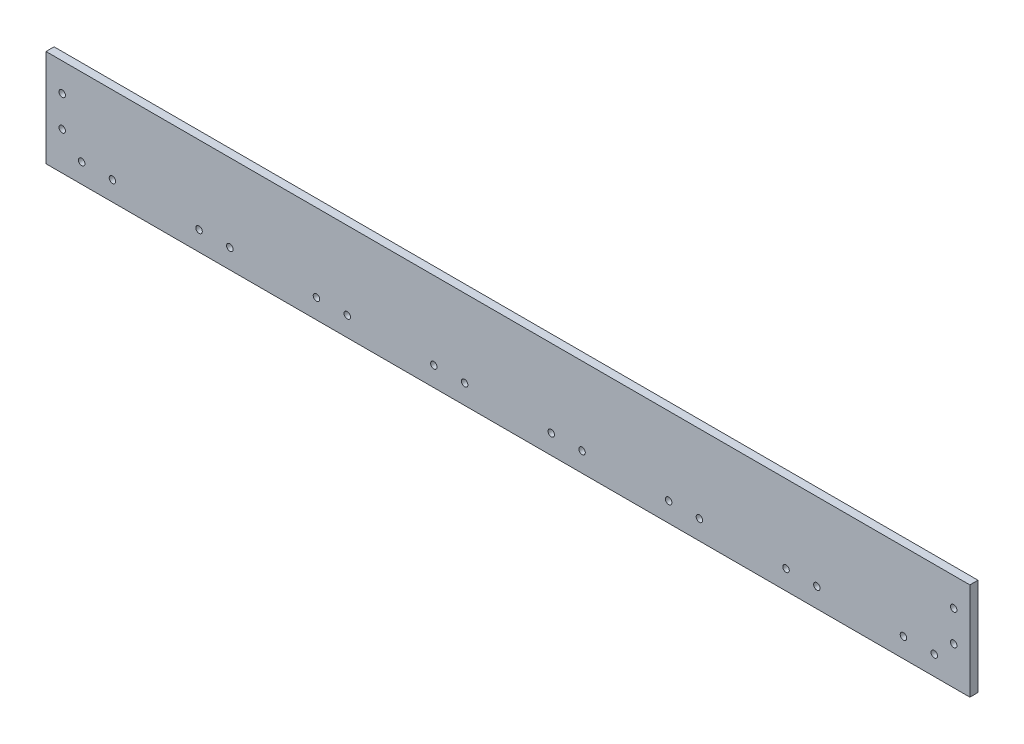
ISO-10303-21;
HEADER;
FILE_DESCRIPTION(('STEP AP214'),'2;1');
FILE_NAME('part.step','',(''),(''),'','','');
FILE_SCHEMA(('AUTOMOTIVE_DESIGN { 1 0 10303 214 1 1 1 1 }'));
ENDSEC;
DATA;
#1=APPLICATION_CONTEXT('core data for automotive mechanical design processes');
#2=APPLICATION_PROTOCOL_DEFINITION('international standard','automotive_design',2000,#1);
#3=PRODUCT_CONTEXT('',#1,'mechanical');
#4=PRODUCT('Part','Part','',(#3));
#5=PRODUCT_RELATED_PRODUCT_CATEGORY('part','',(#4));
#6=PRODUCT_DEFINITION_FORMATION('','',#4);
#7=PRODUCT_DEFINITION_CONTEXT('part definition',#1,'design');
#8=PRODUCT_DEFINITION('design','',#6,#7);
#9=PRODUCT_DEFINITION_SHAPE('','',#8);
#10=(LENGTH_UNIT() NAMED_UNIT(*) SI_UNIT(.MILLI.,.METRE.));
#11=(NAMED_UNIT(*) PLANE_ANGLE_UNIT() SI_UNIT($,.RADIAN.));
#12=(NAMED_UNIT(*) SI_UNIT($,.STERADIAN.) SOLID_ANGLE_UNIT());
#13=UNCERTAINTY_MEASURE_WITH_UNIT(LENGTH_MEASURE(1.E-05),#10,'distance_accuracy_value','');
#14=(GEOMETRIC_REPRESENTATION_CONTEXT(3) GLOBAL_UNCERTAINTY_ASSIGNED_CONTEXT((#13)) GLOBAL_UNIT_ASSIGNED_CONTEXT((#10,
#11,#12)) REPRESENTATION_CONTEXT('',''));
#15=CARTESIAN_POINT('',(0.,0.,0.));
#16=DIRECTION('',(0.,0.,1.));
#17=DIRECTION('',(1.,0.,0.));
#18=AXIS2_PLACEMENT_3D('',#15,#16,#17);
#19=CARTESIAN_POINT('',(0.,0.,6.35));
#20=DIRECTION('',(1.,0.,0.));
#21=DIRECTION('',(0.,1.,0.));
#22=AXIS2_PLACEMENT_3D('',#19,#20,#21);
#23=PLANE('',#22);
#24=DIRECTION('',(0.,-1.,0.));
#25=VECTOR('',#24,1.);
#26=CARTESIAN_POINT('',(0.,0.,0.));
#27=LINE('',#26,#25);
#28=CARTESIAN_POINT('',(0.,76.2,0.));
#29=VERTEX_POINT('',#28);
#30=CARTESIAN_POINT('',(0.,0.,0.));
#31=VERTEX_POINT('',#30);
#32=EDGE_CURVE('E98',#29,#31,#27,.T.);
#33=ORIENTED_EDGE('',*,*,#32,.T.);
#34=DIRECTION('',(0.,0.,-1.));
#35=VECTOR('',#34,1.);
#36=CARTESIAN_POINT('',(0.,0.,6.35));
#37=LINE('',#36,#35);
#38=CARTESIAN_POINT('',(0.,0.,6.35));
#39=VERTEX_POINT('',#38);
#40=EDGE_CURVE('E11',#39,#31,#37,.T.);
#41=ORIENTED_EDGE('',*,*,#40,.F.);
#42=DIRECTION('',(0.,-1.,0.));
#43=VECTOR('',#42,1.);
#44=CARTESIAN_POINT('',(0.,0.,6.35));
#45=LINE('',#44,#43);
#46=CARTESIAN_POINT('',(0.,76.2,6.35));
#47=VERTEX_POINT('',#46);
#48=EDGE_CURVE('E86',#47,#39,#45,.T.);
#49=ORIENTED_EDGE('',*,*,#48,.F.);
#50=DIRECTION('',(0.,0.,-1.));
#51=VECTOR('',#50,1.);
#52=CARTESIAN_POINT('',(0.,76.2,6.35));
#53=LINE('',#52,#51);
#54=EDGE_CURVE('E94',#47,#29,#53,.T.);
#55=ORIENTED_EDGE('',*,*,#54,.T.);
#56=EDGE_LOOP('',(#33,#41,#49,#55));
#57=FACE_BOUND('',#56,.T.);
#58=ADVANCED_FACE('F35',(#57),#23,.F.);
#59=CARTESIAN_POINT('',(0.,0.,6.35));
#60=DIRECTION('',(0.,1.,0.));
#61=DIRECTION('',(0.,0.,1.));
#62=AXIS2_PLACEMENT_3D('',#59,#60,#61);
#63=PLANE('',#62);
#64=DIRECTION('',(1.,0.,0.));
#65=VECTOR('',#64,1.);
#66=CARTESIAN_POINT('',(0.,0.,0.));
#67=LINE('',#66,#65);
#68=CARTESIAN_POINT('',(723.9,0.,0.));
#69=VERTEX_POINT('',#68);
#70=EDGE_CURVE('E90',#31,#69,#67,.T.);
#71=ORIENTED_EDGE('',*,*,#70,.T.);
#72=DIRECTION('',(0.,0.,-1.));
#73=VECTOR('',#72,1.);
#74=CARTESIAN_POINT('',(723.9,0.,6.35));
#75=LINE('',#74,#73);
#76=CARTESIAN_POINT('',(723.9,0.,6.35));
#77=VERTEX_POINT('',#76);
#78=EDGE_CURVE('E43',#77,#69,#75,.T.);
#79=ORIENTED_EDGE('',*,*,#78,.F.);
#80=DIRECTION('',(1.,0.,0.));
#81=VECTOR('',#80,1.);
#82=CARTESIAN_POINT('',(0.,0.,6.35));
#83=LINE('',#82,#81);
#84=EDGE_CURVE('E81',#39,#77,#83,.T.);
#85=ORIENTED_EDGE('',*,*,#84,.F.);
#86=ORIENTED_EDGE('',*,*,#40,.T.);
#87=EDGE_LOOP('',(#71,#79,#85,#86));
#88=FACE_BOUND('',#87,.T.);
#89=ADVANCED_FACE('F89',(#88),#63,.F.);
#90=CARTESIAN_POINT('',(723.9,0.,6.35));
#91=DIRECTION('',(-1.,0.,0.));
#92=DIRECTION('',(0.,0.,1.));
#93=AXIS2_PLACEMENT_3D('',#90,#91,#92);
#94=PLANE('',#93);
#95=DIRECTION('',(0.,1.,0.));
#96=VECTOR('',#95,1.);
#97=CARTESIAN_POINT('',(723.9,0.,0.));
#98=LINE('',#97,#96);
#99=CARTESIAN_POINT('',(723.9,76.2,0.));
#100=VERTEX_POINT('',#99);
#101=EDGE_CURVE('E68',#69,#100,#98,.T.);
#102=ORIENTED_EDGE('',*,*,#101,.T.);
#103=DIRECTION('',(0.,0.,-1.));
#104=VECTOR('',#103,1.);
#105=CARTESIAN_POINT('',(723.9,76.2,6.35));
#106=LINE('',#105,#104);
#107=CARTESIAN_POINT('',(723.9,76.2,6.35));
#108=VERTEX_POINT('',#107);
#109=EDGE_CURVE('E91',#108,#100,#106,.T.);
#110=ORIENTED_EDGE('',*,*,#109,.F.);
#111=DIRECTION('',(0.,1.,0.));
#112=VECTOR('',#111,1.);
#113=CARTESIAN_POINT('',(723.9,0.,6.35));
#114=LINE('',#113,#112);
#115=EDGE_CURVE('E84',#77,#108,#114,.T.);
#116=ORIENTED_EDGE('',*,*,#115,.F.);
#117=ORIENTED_EDGE('',*,*,#78,.T.);
#118=EDGE_LOOP('',(#102,#110,#116,#117));
#119=FACE_BOUND('',#118,.T.);
#120=ADVANCED_FACE('F92',(#119),#94,.F.);
#121=CARTESIAN_POINT('',(0.,76.2,6.35));
#122=DIRECTION('',(0.,-1.,0.));
#123=DIRECTION('',(0.,0.,-1.));
#124=AXIS2_PLACEMENT_3D('',#121,#122,#123);
#125=PLANE('',#124);
#126=DIRECTION('',(-1.,0.,0.));
#127=VECTOR('',#126,1.);
#128=CARTESIAN_POINT('',(0.,76.2,0.));
#129=LINE('',#128,#127);
#130=EDGE_CURVE('E74',#100,#29,#129,.T.);
#131=ORIENTED_EDGE('',*,*,#130,.T.);
#132=ORIENTED_EDGE('',*,*,#54,.F.);
#133=DIRECTION('',(-1.,0.,0.));
#134=VECTOR('',#133,1.);
#135=CARTESIAN_POINT('',(0.,76.2,6.35));
#136=LINE('',#135,#134);
#137=EDGE_CURVE('E51',#108,#47,#136,.T.);
#138=ORIENTED_EDGE('',*,*,#137,.F.);
#139=ORIENTED_EDGE('',*,*,#109,.T.);
#140=EDGE_LOOP('',(#131,#132,#138,#139));
#141=FACE_BOUND('',#140,.T.);
#142=ADVANCED_FACE('F106',(#141),#125,.F.);
#143=CARTESIAN_POINT('',(0.,0.,6.35));
#144=DIRECTION('',(0.,0.,-1.));
#145=DIRECTION('',(-1.,0.,0.));
#146=AXIS2_PLACEMENT_3D('',#143,#144,#145);
#147=PLANE('',#146);
#148=CARTESIAN_POINT('',(671.83,15.24,6.35));
#149=DIRECTION('',(0.,0.,1.));
#150=DIRECTION('',(1.,0.,0.));
#151=AXIS2_PLACEMENT_3D('',#148,#149,#150);
#152=CIRCLE('',#151,2.54000000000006);
#153=CARTESIAN_POINT('',(674.37,15.24,6.35));
#154=VERTEX_POINT('',#153);
#155=EDGE_CURVE('E194',#154,#154,#152,.T.);
#156=ORIENTED_EDGE('',*,*,#155,.F.);
#157=EDGE_LOOP('',(#156));
#158=FACE_BOUND('',#157,.T.);
#159=CARTESIAN_POINT('',(695.96,15.24,6.35));
#160=DIRECTION('',(0.,0.,1.));
#161=DIRECTION('',(1.,0.,0.));
#162=AXIS2_PLACEMENT_3D('',#159,#160,#161);
#163=CIRCLE('',#162,2.54000000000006);
#164=CARTESIAN_POINT('',(698.5,15.24,6.35));
#165=VERTEX_POINT('',#164);
#166=EDGE_CURVE('E193',#165,#165,#163,.T.);
#167=ORIENTED_EDGE('',*,*,#166,.F.);
#168=EDGE_LOOP('',(#167));
#169=FACE_BOUND('',#168,.T.);
#170=CARTESIAN_POINT('',(579.845714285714,15.24,6.35));
#171=DIRECTION('',(0.,0.,1.));
#172=DIRECTION('',(1.,0.,0.));
#173=AXIS2_PLACEMENT_3D('',#170,#171,#172);
#174=CIRCLE('',#173,2.54000000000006);
#175=CARTESIAN_POINT('',(582.385714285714,15.24,6.35));
#176=VERTEX_POINT('',#175);
#177=EDGE_CURVE('E200',#176,#176,#174,.T.);
#178=ORIENTED_EDGE('',*,*,#177,.F.);
#179=EDGE_LOOP('',(#178));
#180=FACE_BOUND('',#179,.T.);
#181=CARTESIAN_POINT('',(603.975714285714,15.24,6.35));
#182=DIRECTION('',(0.,0.,1.));
#183=DIRECTION('',(1.,0.,0.));
#184=AXIS2_PLACEMENT_3D('',#181,#182,#183);
#185=CIRCLE('',#184,2.54000000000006);
#186=CARTESIAN_POINT('',(606.515714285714,15.24,6.35));
#187=VERTEX_POINT('',#186);
#188=EDGE_CURVE('E206',#187,#187,#185,.T.);
#189=ORIENTED_EDGE('',*,*,#188,.F.);
#190=EDGE_LOOP('',(#189));
#191=FACE_BOUND('',#190,.T.);
#192=CARTESIAN_POINT('',(487.861428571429,15.24,6.35));
#193=DIRECTION('',(0.,0.,1.));
#194=DIRECTION('',(1.,0.,0.));
#195=AXIS2_PLACEMENT_3D('',#192,#193,#194);
#196=CIRCLE('',#195,2.54000000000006);
#197=CARTESIAN_POINT('',(490.401428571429,15.24,6.35));
#198=VERTEX_POINT('',#197);
#199=EDGE_CURVE('E212',#198,#198,#196,.T.);
#200=ORIENTED_EDGE('',*,*,#199,.F.);
#201=EDGE_LOOP('',(#200));
#202=FACE_BOUND('',#201,.T.);
#203=CARTESIAN_POINT('',(511.991428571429,15.24,6.35));
#204=DIRECTION('',(0.,0.,1.));
#205=DIRECTION('',(1.,0.,0.));
#206=AXIS2_PLACEMENT_3D('',#203,#204,#205);
#207=CIRCLE('',#206,2.54000000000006);
#208=CARTESIAN_POINT('',(514.531428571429,15.24,6.35));
#209=VERTEX_POINT('',#208);
#210=EDGE_CURVE('E218',#209,#209,#207,.T.);
#211=ORIENTED_EDGE('',*,*,#210,.F.);
#212=EDGE_LOOP('',(#211));
#213=FACE_BOUND('',#212,.T.);
#214=CARTESIAN_POINT('',(395.877142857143,15.24,6.35));
#215=DIRECTION('',(0.,0.,1.));
#216=DIRECTION('',(1.,0.,0.));
#217=AXIS2_PLACEMENT_3D('',#214,#215,#216);
#218=CIRCLE('',#217,2.54000000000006);
#219=CARTESIAN_POINT('',(398.417142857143,15.24,6.35));
#220=VERTEX_POINT('',#219);
#221=EDGE_CURVE('E224',#220,#220,#218,.T.);
#222=ORIENTED_EDGE('',*,*,#221,.F.);
#223=EDGE_LOOP('',(#222));
#224=FACE_BOUND('',#223,.T.);
#225=CARTESIAN_POINT('',(328.022857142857,15.24,6.35));
#226=DIRECTION('',(0.,0.,1.));
#227=DIRECTION('',(1.,0.,0.));
#228=AXIS2_PLACEMENT_3D('',#225,#226,#227);
#229=CIRCLE('',#228,2.54000000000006);
#230=CARTESIAN_POINT('',(330.562857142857,15.24,6.35));
#231=VERTEX_POINT('',#230);
#232=EDGE_CURVE('E158',#231,#231,#229,.T.);
#233=ORIENTED_EDGE('',*,*,#232,.F.);
#234=EDGE_LOOP('',(#233));
#235=FACE_BOUND('',#234,.T.);
#236=CARTESIAN_POINT('',(303.892857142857,15.24,6.35));
#237=DIRECTION('',(0.,0.,1.));
#238=DIRECTION('',(1.,0.,0.));
#239=AXIS2_PLACEMENT_3D('',#236,#237,#238);
#240=CIRCLE('',#239,2.54000000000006);
#241=CARTESIAN_POINT('',(306.432857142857,15.24,6.35));
#242=VERTEX_POINT('',#241);
#243=EDGE_CURVE('E165',#242,#242,#240,.T.);
#244=ORIENTED_EDGE('',*,*,#243,.F.);
#245=EDGE_LOOP('',(#244));
#246=FACE_BOUND('',#245,.T.);
#247=CARTESIAN_POINT('',(420.007142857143,15.24,6.35));
#248=DIRECTION('',(0.,0.,1.));
#249=DIRECTION('',(1.,0.,0.));
#250=AXIS2_PLACEMENT_3D('',#247,#248,#249);
#251=CIRCLE('',#250,2.54000000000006);
#252=CARTESIAN_POINT('',(422.547142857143,15.24,6.35));
#253=VERTEX_POINT('',#252);
#254=EDGE_CURVE('E166',#253,#253,#251,.T.);
#255=ORIENTED_EDGE('',*,*,#254,.F.);
#256=EDGE_LOOP('',(#255));
#257=FACE_BOUND('',#256,.T.);
#258=CARTESIAN_POINT('',(211.908571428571,15.24,6.35));
#259=DIRECTION('',(0.,0.,1.));
#260=DIRECTION('',(1.,0.,0.));
#261=AXIS2_PLACEMENT_3D('',#258,#259,#260);
#262=CIRCLE('',#261,2.54000000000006);
#263=CARTESIAN_POINT('',(214.448571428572,15.24,6.35));
#264=VERTEX_POINT('',#263);
#265=EDGE_CURVE('E157',#264,#264,#262,.T.);
#266=ORIENTED_EDGE('',*,*,#265,.F.);
#267=EDGE_LOOP('',(#266));
#268=FACE_BOUND('',#267,.T.);
#269=CARTESIAN_POINT('',(236.038571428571,15.24,6.35));
#270=DIRECTION('',(0.,0.,1.));
#271=DIRECTION('',(1.,0.,0.));
#272=AXIS2_PLACEMENT_3D('',#269,#270,#271);
#273=CIRCLE('',#272,2.54000000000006);
#274=CARTESIAN_POINT('',(238.578571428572,15.24,6.35));
#275=VERTEX_POINT('',#274);
#276=EDGE_CURVE('E177',#275,#275,#273,.T.);
#277=ORIENTED_EDGE('',*,*,#276,.F.);
#278=EDGE_LOOP('',(#277));
#279=FACE_BOUND('',#278,.T.);
#280=CARTESIAN_POINT('',(119.924285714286,15.24,6.35));
#281=DIRECTION('',(0.,0.,1.));
#282=DIRECTION('',(1.,0.,0.));
#283=AXIS2_PLACEMENT_3D('',#280,#281,#282);
#284=CIRCLE('',#283,2.54000000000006);
#285=CARTESIAN_POINT('',(122.464285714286,15.24,6.35));
#286=VERTEX_POINT('',#285);
#287=EDGE_CURVE('E183',#286,#286,#284,.T.);
#288=ORIENTED_EDGE('',*,*,#287,.F.);
#289=EDGE_LOOP('',(#288));
#290=FACE_BOUND('',#289,.T.);
#291=CARTESIAN_POINT('',(144.054285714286,15.24,6.35));
#292=DIRECTION('',(0.,0.,1.));
#293=DIRECTION('',(1.,0.,0.));
#294=AXIS2_PLACEMENT_3D('',#291,#292,#293);
#295=CIRCLE('',#294,2.54000000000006);
#296=CARTESIAN_POINT('',(146.594285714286,15.24,6.35));
#297=VERTEX_POINT('',#296);
#298=EDGE_CURVE('E150',#297,#297,#295,.T.);
#299=ORIENTED_EDGE('',*,*,#298,.F.);
#300=EDGE_LOOP('',(#299));
#301=FACE_BOUND('',#300,.T.);
#302=CARTESIAN_POINT('',(12.7,53.975,6.35));
#303=DIRECTION('',(0.,0.,1.));
#304=DIRECTION('',(1.,0.,0.));
#305=AXIS2_PLACEMENT_3D('',#302,#303,#304);
#306=CIRCLE('',#305,2.54);
#307=CARTESIAN_POINT('',(15.24,53.975,6.35));
#308=VERTEX_POINT('',#307);
#309=EDGE_CURVE('E141',#308,#308,#306,.T.);
#310=ORIENTED_EDGE('',*,*,#309,.F.);
#311=EDGE_LOOP('',(#310));
#312=FACE_BOUND('',#311,.T.);
#313=CARTESIAN_POINT('',(711.2,29.8450000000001,6.35));
#314=DIRECTION('',(0.,0.,1.));
#315=DIRECTION('',(-1.,0.,0.));
#316=AXIS2_PLACEMENT_3D('',#313,#314,#315);
#317=CIRCLE('',#316,2.54000000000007);
#318=CARTESIAN_POINT('',(713.74,29.8450000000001,6.35));
#319=VERTEX_POINT('',#318);
#320=EDGE_CURVE('E133',#319,#319,#317,.T.);
#321=ORIENTED_EDGE('',*,*,#320,.F.);
#322=EDGE_LOOP('',(#321));
#323=FACE_BOUND('',#322,.T.);
#324=CARTESIAN_POINT('',(711.2,53.9750000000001,6.35));
#325=DIRECTION('',(0.,0.,1.));
#326=DIRECTION('',(-1.,0.,0.));
#327=AXIS2_PLACEMENT_3D('',#324,#325,#326);
#328=CIRCLE('',#327,2.54000000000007);
#329=CARTESIAN_POINT('',(713.74,53.9750000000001,6.35));
#330=VERTEX_POINT('',#329);
#331=EDGE_CURVE('E134',#330,#330,#328,.T.);
#332=ORIENTED_EDGE('',*,*,#331,.F.);
#333=EDGE_LOOP('',(#332));
#334=FACE_BOUND('',#333,.T.);
#335=CARTESIAN_POINT('',(12.7,29.845,6.35));
#336=DIRECTION('',(0.,0.,1.));
#337=DIRECTION('',(1.,0.,0.));
#338=AXIS2_PLACEMENT_3D('',#335,#336,#337);
#339=CIRCLE('',#338,2.54);
#340=CARTESIAN_POINT('',(15.24,29.845,6.35));
#341=VERTEX_POINT('',#340);
#342=EDGE_CURVE('E126',#341,#341,#339,.T.);
#343=ORIENTED_EDGE('',*,*,#342,.F.);
#344=EDGE_LOOP('',(#343));
#345=FACE_BOUND('',#344,.T.);
#346=CARTESIAN_POINT('',(27.94,15.24,6.35));
#347=DIRECTION('',(0.,0.,1.));
#348=DIRECTION('',(1.,0.,0.));
#349=AXIS2_PLACEMENT_3D('',#346,#347,#348);
#350=CIRCLE('',#349,2.54000000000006);
#351=CARTESIAN_POINT('',(30.48,15.24,6.35));
#352=VERTEX_POINT('',#351);
#353=EDGE_CURVE('E117',#352,#352,#350,.T.);
#354=ORIENTED_EDGE('',*,*,#353,.F.);
#355=EDGE_LOOP('',(#354));
#356=FACE_BOUND('',#355,.T.);
#357=CARTESIAN_POINT('',(52.07,15.24,6.35));
#358=DIRECTION('',(0.,0.,1.));
#359=DIRECTION('',(1.,0.,0.));
#360=AXIS2_PLACEMENT_3D('',#357,#358,#359);
#361=CIRCLE('',#360,2.54000000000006);
#362=CARTESIAN_POINT('',(54.6100000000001,15.24,6.35));
#363=VERTEX_POINT('',#362);
#364=EDGE_CURVE('E114',#363,#363,#361,.T.);
#365=ORIENTED_EDGE('',*,*,#364,.F.);
#366=EDGE_LOOP('',(#365));
#367=FACE_BOUND('',#366,.T.);
#368=ORIENTED_EDGE('',*,*,#48,.T.);
#369=ORIENTED_EDGE('',*,*,#84,.T.);
#370=ORIENTED_EDGE('',*,*,#115,.T.);
#371=ORIENTED_EDGE('',*,*,#137,.T.);
#372=EDGE_LOOP('',(#368,#369,#370,#371));
#373=FACE_BOUND('',#372,.T.);
#374=ADVANCED_FACE('F82',(#158,#169,#180,#191,#202,#213,#224,#235,#246,#257,#268,#279,#290,#301,
#312,#323,#334,#345,#356,#367,#373),#147,.F.);
#375=CARTESIAN_POINT('',(0.,0.,0.));
#376=DIRECTION('',(0.,0.,-1.));
#377=DIRECTION('',(-1.,0.,0.));
#378=AXIS2_PLACEMENT_3D('',#375,#376,#377);
#379=PLANE('',#378);
#380=CARTESIAN_POINT('',(671.83,15.24,0.));
#381=DIRECTION('',(0.,0.,-1.));
#382=DIRECTION('',(-1.,0.,0.));
#383=AXIS2_PLACEMENT_3D('',#380,#381,#382);
#384=CIRCLE('',#383,2.54000000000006);
#385=CARTESIAN_POINT('',(669.29,15.24,0.));
#386=VERTEX_POINT('',#385);
#387=EDGE_CURVE('E190',#386,#386,#384,.F.);
#388=ORIENTED_EDGE('',*,*,#387,.T.);
#389=EDGE_LOOP('',(#388));
#390=FACE_BOUND('',#389,.T.);
#391=CARTESIAN_POINT('',(695.96,15.24,0.));
#392=DIRECTION('',(0.,0.,-1.));
#393=DIRECTION('',(-1.,0.,0.));
#394=AXIS2_PLACEMENT_3D('',#391,#392,#393);
#395=CIRCLE('',#394,2.54000000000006);
#396=CARTESIAN_POINT('',(693.42,15.24,0.));
#397=VERTEX_POINT('',#396);
#398=EDGE_CURVE('E197',#397,#397,#395,.F.);
#399=ORIENTED_EDGE('',*,*,#398,.T.);
#400=EDGE_LOOP('',(#399));
#401=FACE_BOUND('',#400,.T.);
#402=CARTESIAN_POINT('',(579.845714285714,15.24,0.));
#403=DIRECTION('',(0.,0.,-1.));
#404=DIRECTION('',(-1.,0.,0.));
#405=AXIS2_PLACEMENT_3D('',#402,#403,#404);
#406=CIRCLE('',#405,2.54000000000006);
#407=CARTESIAN_POINT('',(577.305714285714,15.24,0.));
#408=VERTEX_POINT('',#407);
#409=EDGE_CURVE('E203',#408,#408,#406,.F.);
#410=ORIENTED_EDGE('',*,*,#409,.T.);
#411=EDGE_LOOP('',(#410));
#412=FACE_BOUND('',#411,.T.);
#413=CARTESIAN_POINT('',(603.975714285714,15.24,0.));
#414=DIRECTION('',(0.,0.,-1.));
#415=DIRECTION('',(-1.,0.,0.));
#416=AXIS2_PLACEMENT_3D('',#413,#414,#415);
#417=CIRCLE('',#416,2.54000000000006);
#418=CARTESIAN_POINT('',(601.435714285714,15.24,0.));
#419=VERTEX_POINT('',#418);
#420=EDGE_CURVE('E209',#419,#419,#417,.F.);
#421=ORIENTED_EDGE('',*,*,#420,.T.);
#422=EDGE_LOOP('',(#421));
#423=FACE_BOUND('',#422,.T.);
#424=CARTESIAN_POINT('',(487.861428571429,15.24,0.));
#425=DIRECTION('',(0.,0.,-1.));
#426=DIRECTION('',(-1.,0.,0.));
#427=AXIS2_PLACEMENT_3D('',#424,#425,#426);
#428=CIRCLE('',#427,2.54000000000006);
#429=CARTESIAN_POINT('',(485.321428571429,15.24,0.));
#430=VERTEX_POINT('',#429);
#431=EDGE_CURVE('E215',#430,#430,#428,.F.);
#432=ORIENTED_EDGE('',*,*,#431,.T.);
#433=EDGE_LOOP('',(#432));
#434=FACE_BOUND('',#433,.T.);
#435=CARTESIAN_POINT('',(511.991428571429,15.24,0.));
#436=DIRECTION('',(0.,0.,-1.));
#437=DIRECTION('',(-1.,0.,0.));
#438=AXIS2_PLACEMENT_3D('',#435,#436,#437);
#439=CIRCLE('',#438,2.54000000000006);
#440=CARTESIAN_POINT('',(509.451428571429,15.24,0.));
#441=VERTEX_POINT('',#440);
#442=EDGE_CURVE('E221',#441,#441,#439,.F.);
#443=ORIENTED_EDGE('',*,*,#442,.T.);
#444=EDGE_LOOP('',(#443));
#445=FACE_BOUND('',#444,.T.);
#446=CARTESIAN_POINT('',(395.877142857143,15.24,0.));
#447=DIRECTION('',(0.,0.,-1.));
#448=DIRECTION('',(-1.,0.,0.));
#449=AXIS2_PLACEMENT_3D('',#446,#447,#448);
#450=CIRCLE('',#449,2.54000000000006);
#451=CARTESIAN_POINT('',(398.417142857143,15.24,0.));
#452=VERTEX_POINT('',#451);
#453=EDGE_CURVE('E169',#452,#452,#450,.F.);
#454=ORIENTED_EDGE('',*,*,#453,.T.);
#455=EDGE_LOOP('',(#454));
#456=FACE_BOUND('',#455,.T.);
#457=CARTESIAN_POINT('',(328.022857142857,15.24,0.));
#458=DIRECTION('',(0.,0.,-1.));
#459=DIRECTION('',(-1.,0.,0.));
#460=AXIS2_PLACEMENT_3D('',#457,#458,#459);
#461=CIRCLE('',#460,2.54000000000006);
#462=CARTESIAN_POINT('',(330.562857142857,15.24,0.));
#463=VERTEX_POINT('',#462);
#464=EDGE_CURVE('E154',#463,#463,#461,.F.);
#465=ORIENTED_EDGE('',*,*,#464,.T.);
#466=EDGE_LOOP('',(#465));
#467=FACE_BOUND('',#466,.T.);
#468=CARTESIAN_POINT('',(303.892857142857,15.24,0.));
#469=DIRECTION('',(0.,0.,-1.));
#470=DIRECTION('',(-1.,0.,0.));
#471=AXIS2_PLACEMENT_3D('',#468,#469,#470);
#472=CIRCLE('',#471,2.54000000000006);
#473=CARTESIAN_POINT('',(306.432857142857,15.24,0.));
#474=VERTEX_POINT('',#473);
#475=EDGE_CURVE('E161',#474,#474,#472,.F.);
#476=ORIENTED_EDGE('',*,*,#475,.T.);
#477=EDGE_LOOP('',(#476));
#478=FACE_BOUND('',#477,.T.);
#479=CARTESIAN_POINT('',(420.007142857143,15.24,0.));
#480=DIRECTION('',(0.,0.,-1.));
#481=DIRECTION('',(-1.,0.,0.));
#482=AXIS2_PLACEMENT_3D('',#479,#480,#481);
#483=CIRCLE('',#482,2.54000000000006);
#484=CARTESIAN_POINT('',(422.547142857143,15.24,0.));
#485=VERTEX_POINT('',#484);
#486=EDGE_CURVE('E162',#485,#485,#483,.F.);
#487=ORIENTED_EDGE('',*,*,#486,.T.);
#488=EDGE_LOOP('',(#487));
#489=FACE_BOUND('',#488,.T.);
#490=CARTESIAN_POINT('',(211.908571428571,15.24,0.));
#491=DIRECTION('',(0.,0.,-1.));
#492=DIRECTION('',(-1.,0.,0.));
#493=AXIS2_PLACEMENT_3D('',#490,#491,#492);
#494=CIRCLE('',#493,2.54000000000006);
#495=CARTESIAN_POINT('',(209.368571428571,15.24,0.));
#496=VERTEX_POINT('',#495);
#497=EDGE_CURVE('E174',#496,#496,#494,.F.);
#498=ORIENTED_EDGE('',*,*,#497,.T.);
#499=EDGE_LOOP('',(#498));
#500=FACE_BOUND('',#499,.T.);
#501=CARTESIAN_POINT('',(236.038571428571,15.24,0.));
#502=DIRECTION('',(0.,0.,-1.));
#503=DIRECTION('',(-1.,0.,0.));
#504=AXIS2_PLACEMENT_3D('',#501,#502,#503);
#505=CIRCLE('',#504,2.54000000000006);
#506=CARTESIAN_POINT('',(233.498571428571,15.24,0.));
#507=VERTEX_POINT('',#506);
#508=EDGE_CURVE('E180',#507,#507,#505,.F.);
#509=ORIENTED_EDGE('',*,*,#508,.T.);
#510=EDGE_LOOP('',(#509));
#511=FACE_BOUND('',#510,.T.);
#512=CARTESIAN_POINT('',(119.924285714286,15.24,0.));
#513=DIRECTION('',(0.,0.,-1.));
#514=DIRECTION('',(-1.,0.,0.));
#515=AXIS2_PLACEMENT_3D('',#512,#513,#514);
#516=CIRCLE('',#515,2.54000000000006);
#517=CARTESIAN_POINT('',(117.384285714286,15.24,0.));
#518=VERTEX_POINT('',#517);
#519=EDGE_CURVE('E153',#518,#518,#516,.F.);
#520=ORIENTED_EDGE('',*,*,#519,.T.);
#521=EDGE_LOOP('',(#520));
#522=FACE_BOUND('',#521,.T.);
#523=CARTESIAN_POINT('',(144.054285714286,15.24,0.));
#524=DIRECTION('',(0.,0.,-1.));
#525=DIRECTION('',(-1.,0.,0.));
#526=AXIS2_PLACEMENT_3D('',#523,#524,#525);
#527=CIRCLE('',#526,2.54000000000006);
#528=CARTESIAN_POINT('',(141.514285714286,15.24,0.));
#529=VERTEX_POINT('',#528);
#530=EDGE_CURVE('E137',#529,#529,#527,.F.);
#531=ORIENTED_EDGE('',*,*,#530,.T.);
#532=EDGE_LOOP('',(#531));
#533=FACE_BOUND('',#532,.T.);
#534=CARTESIAN_POINT('',(12.7,53.975,0.));
#535=DIRECTION('',(0.,0.,-1.));
#536=DIRECTION('',(-1.,0.,0.));
#537=AXIS2_PLACEMENT_3D('',#534,#535,#536);
#538=CIRCLE('',#537,2.54);
#539=CARTESIAN_POINT('',(15.24,53.975,0.));
#540=VERTEX_POINT('',#539);
#541=EDGE_CURVE('E129',#540,#540,#538,.F.);
#542=ORIENTED_EDGE('',*,*,#541,.T.);
#543=EDGE_LOOP('',(#542));
#544=FACE_BOUND('',#543,.T.);
#545=CARTESIAN_POINT('',(711.2,29.8450000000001,0.));
#546=DIRECTION('',(0.,0.,-1.));
#547=DIRECTION('',(-1.,0.,0.));
#548=AXIS2_PLACEMENT_3D('',#545,#546,#547);
#549=CIRCLE('',#548,2.54000000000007);
#550=CARTESIAN_POINT('',(713.74,29.8450000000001,0.));
#551=VERTEX_POINT('',#550);
#552=EDGE_CURVE('E138',#551,#551,#549,.F.);
#553=ORIENTED_EDGE('',*,*,#552,.T.);
#554=EDGE_LOOP('',(#553));
#555=FACE_BOUND('',#554,.T.);
#556=CARTESIAN_POINT('',(711.2,53.9750000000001,0.));
#557=DIRECTION('',(0.,0.,-1.));
#558=DIRECTION('',(-1.,0.,0.));
#559=AXIS2_PLACEMENT_3D('',#556,#557,#558);
#560=CIRCLE('',#559,2.54000000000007);
#561=CARTESIAN_POINT('',(713.74,53.9750000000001,0.));
#562=VERTEX_POINT('',#561);
#563=EDGE_CURVE('E130',#562,#562,#560,.F.);
#564=ORIENTED_EDGE('',*,*,#563,.T.);
#565=EDGE_LOOP('',(#564));
#566=FACE_BOUND('',#565,.T.);
#567=CARTESIAN_POINT('',(12.7,29.845,0.));
#568=DIRECTION('',(0.,0.,-1.));
#569=DIRECTION('',(-1.,0.,0.));
#570=AXIS2_PLACEMENT_3D('',#567,#568,#569);
#571=CIRCLE('',#570,2.54);
#572=CARTESIAN_POINT('',(15.24,29.845,0.));
#573=VERTEX_POINT('',#572);
#574=EDGE_CURVE('E123',#573,#573,#571,.F.);
#575=ORIENTED_EDGE('',*,*,#574,.T.);
#576=EDGE_LOOP('',(#575));
#577=FACE_BOUND('',#576,.T.);
#578=CARTESIAN_POINT('',(27.94,15.24,0.));
#579=DIRECTION('',(0.,0.,-1.));
#580=DIRECTION('',(-1.,0.,0.));
#581=AXIS2_PLACEMENT_3D('',#578,#579,#580);
#582=CIRCLE('',#581,2.54000000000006);
#583=CARTESIAN_POINT('',(25.3999999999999,15.24,0.));
#584=VERTEX_POINT('',#583);
#585=EDGE_CURVE('E120',#584,#584,#582,.F.);
#586=ORIENTED_EDGE('',*,*,#585,.T.);
#587=EDGE_LOOP('',(#586));
#588=FACE_BOUND('',#587,.T.);
#589=CARTESIAN_POINT('',(52.07,15.24,0.));
#590=DIRECTION('',(0.,0.,-1.));
#591=DIRECTION('',(-1.,0.,0.));
#592=AXIS2_PLACEMENT_3D('',#589,#590,#591);
#593=CIRCLE('',#592,2.54000000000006);
#594=CARTESIAN_POINT('',(49.5299999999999,15.24,0.));
#595=VERTEX_POINT('',#594);
#596=EDGE_CURVE('E101',#595,#595,#593,.F.);
#597=ORIENTED_EDGE('',*,*,#596,.T.);
#598=EDGE_LOOP('',(#597));
#599=FACE_BOUND('',#598,.T.);
#600=ORIENTED_EDGE('',*,*,#32,.F.);
#601=ORIENTED_EDGE('',*,*,#130,.F.);
#602=ORIENTED_EDGE('',*,*,#101,.F.);
#603=ORIENTED_EDGE('',*,*,#70,.F.);
#604=EDGE_LOOP('',(#600,#601,#602,#603));
#605=FACE_BOUND('',#604,.T.);
#606=ADVANCED_FACE('F109',(#390,#401,#412,#423,#434,#445,#456,#467,#478,#489,#500,#511,#522,
#533,#544,#555,#566,#577,#588,#599,#605),#379,.T.);
#607=CARTESIAN_POINT('',(52.07,15.24,-7.1842048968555));
#608=DIRECTION('',(0.,0.,1.));
#609=DIRECTION('',(1.,0.,0.));
#610=AXIS2_PLACEMENT_3D('',#607,#608,#609);
#611=CYLINDRICAL_SURFACE('',#610,2.54000000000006);
#612=ORIENTED_EDGE('',*,*,#364,.T.);
#613=EDGE_LOOP('',(#612));
#614=FACE_BOUND('',#613,.T.);
#615=ORIENTED_EDGE('',*,*,#596,.F.);
#616=EDGE_LOOP('',(#615));
#617=FACE_BOUND('',#616,.T.);
#618=ADVANCED_FACE('F265',(#614,#617),#611,.F.);
#619=CARTESIAN_POINT('',(27.94,15.24,-7.1842048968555));
#620=DIRECTION('',(0.,0.,1.));
#621=DIRECTION('',(1.,0.,0.));
#622=AXIS2_PLACEMENT_3D('',#619,#620,#621);
#623=CYLINDRICAL_SURFACE('',#622,2.54000000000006);
#624=ORIENTED_EDGE('',*,*,#353,.T.);
#625=EDGE_LOOP('',(#624));
#626=FACE_BOUND('',#625,.T.);
#627=ORIENTED_EDGE('',*,*,#585,.F.);
#628=EDGE_LOOP('',(#627));
#629=FACE_BOUND('',#628,.T.);
#630=ADVANCED_FACE('F268',(#626,#629),#623,.F.);
#631=CARTESIAN_POINT('',(12.7,29.845,-7.18420489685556));
#632=DIRECTION('',(0.,0.,1.));
#633=DIRECTION('',(1.,0.,0.));
#634=AXIS2_PLACEMENT_3D('',#631,#632,#633);
#635=CYLINDRICAL_SURFACE('',#634,2.54);
#636=CARTESIAN_POINT('',(15.24,29.845,6.35));
#637=CARTESIAN_POINT('',(15.24,29.845,6.28385416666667));
#638=CARTESIAN_POINT('',(15.24,29.845,6.21770833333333));
#639=CARTESIAN_POINT('',(15.24,29.845,6.08541666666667));
#640=CARTESIAN_POINT('',(15.24,29.845,6.01927083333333));
#641=CARTESIAN_POINT('',(15.24,29.845,5.88697916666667));
#642=CARTESIAN_POINT('',(15.24,29.845,5.82083333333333));
#643=CARTESIAN_POINT('',(15.24,29.845,5.68854166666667));
#644=CARTESIAN_POINT('',(15.24,29.845,5.62239583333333));
#645=CARTESIAN_POINT('',(15.24,29.845,5.49010416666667));
#646=CARTESIAN_POINT('',(15.24,29.845,5.42395833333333));
#647=CARTESIAN_POINT('',(15.24,29.845,5.29166666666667));
#648=CARTESIAN_POINT('',(15.24,29.845,5.22552083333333));
#649=CARTESIAN_POINT('',(15.24,29.845,5.09322916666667));
#650=CARTESIAN_POINT('',(15.24,29.845,5.02708333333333));
#651=CARTESIAN_POINT('',(15.24,29.845,4.89479166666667));
#652=CARTESIAN_POINT('',(15.24,29.845,4.82864583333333));
#653=CARTESIAN_POINT('',(15.24,29.845,4.69635416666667));
#654=CARTESIAN_POINT('',(15.24,29.845,4.63020833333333));
#655=CARTESIAN_POINT('',(15.24,29.845,4.49791666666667));
#656=CARTESIAN_POINT('',(15.24,29.845,4.43177083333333));
#657=CARTESIAN_POINT('',(15.24,29.845,4.29947916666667));
#658=CARTESIAN_POINT('',(15.24,29.845,4.23333333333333));
#659=CARTESIAN_POINT('',(15.24,29.845,4.10104166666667));
#660=CARTESIAN_POINT('',(15.24,29.845,4.03489583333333));
#661=CARTESIAN_POINT('',(15.24,29.845,3.90260416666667));
#662=CARTESIAN_POINT('',(15.24,29.845,3.83645833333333));
#663=CARTESIAN_POINT('',(15.24,29.845,3.70416666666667));
#664=CARTESIAN_POINT('',(15.24,29.845,3.63802083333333));
#665=CARTESIAN_POINT('',(15.24,29.845,3.50572916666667));
#666=CARTESIAN_POINT('',(15.24,29.845,3.43958333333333));
#667=CARTESIAN_POINT('',(15.24,29.845,3.30729166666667));
#668=CARTESIAN_POINT('',(15.24,29.845,3.24114583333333));
#669=CARTESIAN_POINT('',(15.24,29.845,3.10885416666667));
#670=CARTESIAN_POINT('',(15.24,29.845,3.04270833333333));
#671=CARTESIAN_POINT('',(15.24,29.845,2.91041666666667));
#672=CARTESIAN_POINT('',(15.24,29.845,2.84427083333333));
#673=CARTESIAN_POINT('',(15.24,29.845,2.71197916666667));
#674=CARTESIAN_POINT('',(15.24,29.845,2.64583333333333));
#675=CARTESIAN_POINT('',(15.24,29.845,2.51354166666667));
#676=CARTESIAN_POINT('',(15.24,29.845,2.44739583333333));
#677=CARTESIAN_POINT('',(15.24,29.845,2.31510416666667));
#678=CARTESIAN_POINT('',(15.24,29.845,2.24895833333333));
#679=CARTESIAN_POINT('',(15.24,29.845,2.11666666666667));
#680=CARTESIAN_POINT('',(15.24,29.845,2.05052083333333));
#681=CARTESIAN_POINT('',(15.24,29.845,1.91822916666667));
#682=CARTESIAN_POINT('',(15.24,29.845,1.85208333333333));
#683=CARTESIAN_POINT('',(15.24,29.845,1.71979166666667));
#684=CARTESIAN_POINT('',(15.24,29.845,1.65364583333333));
#685=CARTESIAN_POINT('',(15.24,29.845,1.52135416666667));
#686=CARTESIAN_POINT('',(15.24,29.845,1.45520833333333));
#687=CARTESIAN_POINT('',(15.24,29.845,1.32291666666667));
#688=CARTESIAN_POINT('',(15.24,29.845,1.25677083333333));
#689=CARTESIAN_POINT('',(15.24,29.845,1.12447916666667));
#690=CARTESIAN_POINT('',(15.24,29.845,1.05833333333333));
#691=CARTESIAN_POINT('',(15.24,29.845,0.926041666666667));
#692=CARTESIAN_POINT('',(15.24,29.845,0.859895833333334));
#693=CARTESIAN_POINT('',(15.24,29.845,0.727604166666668));
#694=CARTESIAN_POINT('',(15.24,29.845,0.661458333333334));
#695=CARTESIAN_POINT('',(15.24,29.845,0.529166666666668));
#696=CARTESIAN_POINT('',(15.24,29.845,0.463020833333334));
#697=CARTESIAN_POINT('',(15.24,29.845,0.330729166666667));
#698=CARTESIAN_POINT('',(15.24,29.845,0.264583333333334));
#699=CARTESIAN_POINT('',(15.24,29.845,0.132291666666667));
#700=CARTESIAN_POINT('',(15.24,29.845,0.0661458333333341));
#701=CARTESIAN_POINT('',(15.24,29.845,0.));
#702=B_SPLINE_CURVE_WITH_KNOTS('',3,(#636,#637,#638,#639,#640,#641,#642,#643,#644,#645,#646,
#647,#648,#649,#650,#651,#652,#653,#654,#655,#656,#657,#658,#659,#660,#661,#662,#663,#664,#665,
#666,#667,#668,#669,#670,#671,#672,#673,#674,#675,#676,#677,#678,#679,#680,#681,#682,#683,#684,
#685,#686,#687,#688,#689,#690,#691,#692,#693,#694,#695,#696,#697,#698,#699,#700,#701),
.UNSPECIFIED.,.F.,.F.,(4,2,2,2,2,2,2,2,2,2,2,2,2,2,2,2,2,2,2,2,2,2,2,2,2,2,2,2,2,2,2,2,4),(0.,
0.198437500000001,0.396875,0.5953125,0.793749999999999,0.9921875,1.190625,1.3890625,1.5875,
1.7859375,1.984375,2.1828125,2.38125,2.5796875,2.778125,2.9765625,3.175,3.3734375,3.571875,
3.7703125,3.96875,4.1671875,4.365625,4.5640625,4.7625,4.9609375,5.159375,5.3578125,5.55625,
5.7546875,5.953125,6.1515625,6.35),.UNSPECIFIED.);
#703=EDGE_CURVE('BSEAM461',#341,#573,#702,.T.);
#704=ORIENTED_EDGE('',*,*,#342,.T.);
#705=ORIENTED_EDGE('',*,*,#574,.F.);
#706=ORIENTED_EDGE('',*,*,#703,.T.);
#707=ORIENTED_EDGE('',*,*,#703,.F.);
#708=EDGE_LOOP('',(#704,#706,#705,#707));
#709=FACE_BOUND('',#708,.T.);
#710=ADVANCED_FACE('F461',(#709),#635,.F.);
#711=CARTESIAN_POINT('',(711.2,53.9750000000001,-7.18420489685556));
#712=DIRECTION('',(0.,0.,1.));
#713=DIRECTION('',(1.,0.,0.));
#714=AXIS2_PLACEMENT_3D('',#711,#712,#713);
#715=CYLINDRICAL_SURFACE('',#714,2.54000000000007);
#716=CARTESIAN_POINT('',(713.74,53.9750000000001,6.35));
#717=CARTESIAN_POINT('',(713.74,53.9750000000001,6.28385416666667));
#718=CARTESIAN_POINT('',(713.74,53.9750000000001,6.21770833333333));
#719=CARTESIAN_POINT('',(713.74,53.9750000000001,6.08541666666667));
#720=CARTESIAN_POINT('',(713.74,53.9750000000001,6.01927083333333));
#721=CARTESIAN_POINT('',(713.74,53.9750000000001,5.88697916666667));
#722=CARTESIAN_POINT('',(713.74,53.9750000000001,5.82083333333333));
#723=CARTESIAN_POINT('',(713.74,53.9750000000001,5.68854166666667));
#724=CARTESIAN_POINT('',(713.74,53.9750000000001,5.62239583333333));
#725=CARTESIAN_POINT('',(713.74,53.9750000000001,5.49010416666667));
#726=CARTESIAN_POINT('',(713.74,53.9750000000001,5.42395833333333));
#727=CARTESIAN_POINT('',(713.74,53.9750000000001,5.29166666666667));
#728=CARTESIAN_POINT('',(713.74,53.9750000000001,5.22552083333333));
#729=CARTESIAN_POINT('',(713.74,53.9750000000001,5.09322916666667));
#730=CARTESIAN_POINT('',(713.74,53.9750000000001,5.02708333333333));
#731=CARTESIAN_POINT('',(713.74,53.9750000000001,4.89479166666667));
#732=CARTESIAN_POINT('',(713.74,53.9750000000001,4.82864583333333));
#733=CARTESIAN_POINT('',(713.74,53.9750000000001,4.69635416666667));
#734=CARTESIAN_POINT('',(713.74,53.9750000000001,4.63020833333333));
#735=CARTESIAN_POINT('',(713.74,53.9750000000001,4.49791666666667));
#736=CARTESIAN_POINT('',(713.74,53.9750000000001,4.43177083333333));
#737=CARTESIAN_POINT('',(713.74,53.9750000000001,4.29947916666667));
#738=CARTESIAN_POINT('',(713.74,53.9750000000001,4.23333333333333));
#739=CARTESIAN_POINT('',(713.74,53.9750000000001,4.10104166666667));
#740=CARTESIAN_POINT('',(713.74,53.9750000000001,4.03489583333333));
#741=CARTESIAN_POINT('',(713.74,53.9750000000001,3.90260416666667));
#742=CARTESIAN_POINT('',(713.74,53.9750000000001,3.83645833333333));
#743=CARTESIAN_POINT('',(713.74,53.9750000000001,3.70416666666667));
#744=CARTESIAN_POINT('',(713.74,53.9750000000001,3.63802083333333));
#745=CARTESIAN_POINT('',(713.74,53.9750000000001,3.50572916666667));
#746=CARTESIAN_POINT('',(713.74,53.9750000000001,3.43958333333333));
#747=CARTESIAN_POINT('',(713.74,53.9750000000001,3.30729166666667));
#748=CARTESIAN_POINT('',(713.74,53.9750000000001,3.24114583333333));
#749=CARTESIAN_POINT('',(713.74,53.9750000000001,3.10885416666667));
#750=CARTESIAN_POINT('',(713.74,53.9750000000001,3.04270833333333));
#751=CARTESIAN_POINT('',(713.74,53.9750000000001,2.91041666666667));
#752=CARTESIAN_POINT('',(713.74,53.9750000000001,2.84427083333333));
#753=CARTESIAN_POINT('',(713.74,53.9750000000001,2.71197916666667));
#754=CARTESIAN_POINT('',(713.74,53.9750000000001,2.64583333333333));
#755=CARTESIAN_POINT('',(713.74,53.9750000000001,2.51354166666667));
#756=CARTESIAN_POINT('',(713.74,53.9750000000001,2.44739583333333));
#757=CARTESIAN_POINT('',(713.74,53.9750000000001,2.31510416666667));
#758=CARTESIAN_POINT('',(713.74,53.9750000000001,2.24895833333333));
#759=CARTESIAN_POINT('',(713.74,53.9750000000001,2.11666666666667));
#760=CARTESIAN_POINT('',(713.74,53.9750000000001,2.05052083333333));
#761=CARTESIAN_POINT('',(713.74,53.9750000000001,1.91822916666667));
#762=CARTESIAN_POINT('',(713.74,53.9750000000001,1.85208333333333));
#763=CARTESIAN_POINT('',(713.74,53.9750000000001,1.71979166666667));
#764=CARTESIAN_POINT('',(713.74,53.9750000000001,1.65364583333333));
#765=CARTESIAN_POINT('',(713.74,53.9750000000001,1.52135416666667));
#766=CARTESIAN_POINT('',(713.74,53.9750000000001,1.45520833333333));
#767=CARTESIAN_POINT('',(713.74,53.9750000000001,1.32291666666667));
#768=CARTESIAN_POINT('',(713.74,53.9750000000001,1.25677083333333));
#769=CARTESIAN_POINT('',(713.74,53.9750000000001,1.12447916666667));
#770=CARTESIAN_POINT('',(713.74,53.9750000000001,1.05833333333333));
#771=CARTESIAN_POINT('',(713.74,53.9750000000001,0.926041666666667));
#772=CARTESIAN_POINT('',(713.74,53.9750000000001,0.859895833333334));
#773=CARTESIAN_POINT('',(713.74,53.9750000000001,0.727604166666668));
#774=CARTESIAN_POINT('',(713.74,53.9750000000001,0.661458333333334));
#775=CARTESIAN_POINT('',(713.74,53.9750000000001,0.529166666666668));
#776=CARTESIAN_POINT('',(713.74,53.9750000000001,0.463020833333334));
#777=CARTESIAN_POINT('',(713.74,53.9750000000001,0.330729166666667));
#778=CARTESIAN_POINT('',(713.74,53.9750000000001,0.264583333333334));
#779=CARTESIAN_POINT('',(713.74,53.9750000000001,0.132291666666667));
#780=CARTESIAN_POINT('',(713.74,53.9750000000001,0.0661458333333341));
#781=CARTESIAN_POINT('',(713.74,53.9750000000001,0.));
#782=B_SPLINE_CURVE_WITH_KNOTS('',3,(#716,#717,#718,#719,#720,#721,#722,#723,#724,#725,#726,
#727,#728,#729,#730,#731,#732,#733,#734,#735,#736,#737,#738,#739,#740,#741,#742,#743,#744,#745,
#746,#747,#748,#749,#750,#751,#752,#753,#754,#755,#756,#757,#758,#759,#760,#761,#762,#763,#764,
#765,#766,#767,#768,#769,#770,#771,#772,#773,#774,#775,#776,#777,#778,#779,#780,#781),
.UNSPECIFIED.,.F.,.F.,(4,2,2,2,2,2,2,2,2,2,2,2,2,2,2,2,2,2,2,2,2,2,2,2,2,2,2,2,2,2,2,2,4),(0.,
0.198437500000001,0.396875,0.5953125,0.793749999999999,0.9921875,1.190625,1.3890625,1.5875,
1.7859375,1.984375,2.1828125,2.38125,2.5796875,2.778125,2.9765625,3.175,3.3734375,3.571875,
3.7703125,3.96875,4.1671875,4.365625,4.5640625,4.7625,4.9609375,5.159375,5.3578125,5.55625,
5.7546875,5.953125,6.1515625,6.35),.UNSPECIFIED.);
#783=EDGE_CURVE('BSEAM457',#330,#562,#782,.T.);
#784=ORIENTED_EDGE('',*,*,#331,.T.);
#785=ORIENTED_EDGE('',*,*,#563,.F.);
#786=ORIENTED_EDGE('',*,*,#783,.T.);
#787=ORIENTED_EDGE('',*,*,#783,.F.);
#788=EDGE_LOOP('',(#784,#786,#785,#787));
#789=FACE_BOUND('',#788,.T.);
#790=ADVANCED_FACE('F457',(#789),#715,.F.);
#791=CARTESIAN_POINT('',(711.2,29.8450000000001,-7.18420489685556));
#792=DIRECTION('',(0.,0.,1.));
#793=DIRECTION('',(1.,0.,0.));
#794=AXIS2_PLACEMENT_3D('',#791,#792,#793);
#795=CYLINDRICAL_SURFACE('',#794,2.54000000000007);
#796=CARTESIAN_POINT('',(713.74,29.8450000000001,6.35));
#797=CARTESIAN_POINT('',(713.74,29.8450000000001,6.28385416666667));
#798=CARTESIAN_POINT('',(713.74,29.8450000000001,6.21770833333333));
#799=CARTESIAN_POINT('',(713.74,29.8450000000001,6.08541666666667));
#800=CARTESIAN_POINT('',(713.74,29.8450000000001,6.01927083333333));
#801=CARTESIAN_POINT('',(713.74,29.8450000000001,5.88697916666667));
#802=CARTESIAN_POINT('',(713.74,29.8450000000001,5.82083333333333));
#803=CARTESIAN_POINT('',(713.74,29.8450000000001,5.68854166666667));
#804=CARTESIAN_POINT('',(713.74,29.8450000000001,5.62239583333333));
#805=CARTESIAN_POINT('',(713.74,29.8450000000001,5.49010416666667));
#806=CARTESIAN_POINT('',(713.74,29.8450000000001,5.42395833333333));
#807=CARTESIAN_POINT('',(713.74,29.8450000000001,5.29166666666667));
#808=CARTESIAN_POINT('',(713.74,29.8450000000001,5.22552083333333));
#809=CARTESIAN_POINT('',(713.74,29.8450000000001,5.09322916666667));
#810=CARTESIAN_POINT('',(713.74,29.8450000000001,5.02708333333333));
#811=CARTESIAN_POINT('',(713.74,29.8450000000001,4.89479166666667));
#812=CARTESIAN_POINT('',(713.74,29.8450000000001,4.82864583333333));
#813=CARTESIAN_POINT('',(713.74,29.8450000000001,4.69635416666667));
#814=CARTESIAN_POINT('',(713.74,29.8450000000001,4.63020833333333));
#815=CARTESIAN_POINT('',(713.74,29.8450000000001,4.49791666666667));
#816=CARTESIAN_POINT('',(713.74,29.8450000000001,4.43177083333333));
#817=CARTESIAN_POINT('',(713.74,29.8450000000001,4.29947916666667));
#818=CARTESIAN_POINT('',(713.74,29.8450000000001,4.23333333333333));
#819=CARTESIAN_POINT('',(713.74,29.8450000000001,4.10104166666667));
#820=CARTESIAN_POINT('',(713.74,29.8450000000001,4.03489583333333));
#821=CARTESIAN_POINT('',(713.74,29.8450000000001,3.90260416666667));
#822=CARTESIAN_POINT('',(713.74,29.8450000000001,3.83645833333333));
#823=CARTESIAN_POINT('',(713.74,29.8450000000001,3.70416666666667));
#824=CARTESIAN_POINT('',(713.74,29.8450000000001,3.63802083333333));
#825=CARTESIAN_POINT('',(713.74,29.8450000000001,3.50572916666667));
#826=CARTESIAN_POINT('',(713.74,29.8450000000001,3.43958333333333));
#827=CARTESIAN_POINT('',(713.74,29.8450000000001,3.30729166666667));
#828=CARTESIAN_POINT('',(713.74,29.8450000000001,3.24114583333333));
#829=CARTESIAN_POINT('',(713.74,29.8450000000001,3.10885416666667));
#830=CARTESIAN_POINT('',(713.74,29.8450000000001,3.04270833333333));
#831=CARTESIAN_POINT('',(713.74,29.8450000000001,2.91041666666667));
#832=CARTESIAN_POINT('',(713.74,29.8450000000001,2.84427083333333));
#833=CARTESIAN_POINT('',(713.74,29.8450000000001,2.71197916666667));
#834=CARTESIAN_POINT('',(713.74,29.8450000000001,2.64583333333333));
#835=CARTESIAN_POINT('',(713.74,29.8450000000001,2.51354166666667));
#836=CARTESIAN_POINT('',(713.74,29.8450000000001,2.44739583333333));
#837=CARTESIAN_POINT('',(713.74,29.8450000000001,2.31510416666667));
#838=CARTESIAN_POINT('',(713.74,29.8450000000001,2.24895833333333));
#839=CARTESIAN_POINT('',(713.74,29.8450000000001,2.11666666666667));
#840=CARTESIAN_POINT('',(713.74,29.8450000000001,2.05052083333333));
#841=CARTESIAN_POINT('',(713.74,29.8450000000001,1.91822916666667));
#842=CARTESIAN_POINT('',(713.74,29.8450000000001,1.85208333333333));
#843=CARTESIAN_POINT('',(713.74,29.8450000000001,1.71979166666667));
#844=CARTESIAN_POINT('',(713.74,29.8450000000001,1.65364583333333));
#845=CARTESIAN_POINT('',(713.74,29.8450000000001,1.52135416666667));
#846=CARTESIAN_POINT('',(713.74,29.8450000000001,1.45520833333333));
#847=CARTESIAN_POINT('',(713.74,29.8450000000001,1.32291666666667));
#848=CARTESIAN_POINT('',(713.74,29.8450000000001,1.25677083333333));
#849=CARTESIAN_POINT('',(713.74,29.8450000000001,1.12447916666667));
#850=CARTESIAN_POINT('',(713.74,29.8450000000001,1.05833333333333));
#851=CARTESIAN_POINT('',(713.74,29.8450000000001,0.926041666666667));
#852=CARTESIAN_POINT('',(713.74,29.8450000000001,0.859895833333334));
#853=CARTESIAN_POINT('',(713.74,29.8450000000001,0.727604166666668));
#854=CARTESIAN_POINT('',(713.74,29.8450000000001,0.661458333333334));
#855=CARTESIAN_POINT('',(713.74,29.8450000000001,0.529166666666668));
#856=CARTESIAN_POINT('',(713.74,29.8450000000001,0.463020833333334));
#857=CARTESIAN_POINT('',(713.74,29.8450000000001,0.330729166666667));
#858=CARTESIAN_POINT('',(713.74,29.8450000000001,0.264583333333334));
#859=CARTESIAN_POINT('',(713.74,29.8450000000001,0.132291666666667));
#860=CARTESIAN_POINT('',(713.74,29.8450000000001,0.0661458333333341));
#861=CARTESIAN_POINT('',(713.74,29.8450000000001,0.));
#862=B_SPLINE_CURVE_WITH_KNOTS('',3,(#796,#797,#798,#799,#800,#801,#802,#803,#804,#805,#806,
#807,#808,#809,#810,#811,#812,#813,#814,#815,#816,#817,#818,#819,#820,#821,#822,#823,#824,#825,
#826,#827,#828,#829,#830,#831,#832,#833,#834,#835,#836,#837,#838,#839,#840,#841,#842,#843,#844,
#845,#846,#847,#848,#849,#850,#851,#852,#853,#854,#855,#856,#857,#858,#859,#860,#861),
.UNSPECIFIED.,.F.,.F.,(4,2,2,2,2,2,2,2,2,2,2,2,2,2,2,2,2,2,2,2,2,2,2,2,2,2,2,2,2,2,2,2,4),(0.,
0.198437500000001,0.396875,0.5953125,0.793749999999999,0.9921875,1.190625,1.3890625,1.5875,
1.7859375,1.984375,2.1828125,2.38125,2.5796875,2.778125,2.9765625,3.175,3.3734375,3.571875,
3.7703125,3.96875,4.1671875,4.365625,4.5640625,4.7625,4.9609375,5.159375,5.3578125,5.55625,
5.7546875,5.953125,6.1515625,6.35),.UNSPECIFIED.);
#863=EDGE_CURVE('BSEAM453',#319,#551,#862,.T.);
#864=ORIENTED_EDGE('',*,*,#320,.T.);
#865=ORIENTED_EDGE('',*,*,#552,.F.);
#866=ORIENTED_EDGE('',*,*,#863,.T.);
#867=ORIENTED_EDGE('',*,*,#863,.F.);
#868=EDGE_LOOP('',(#864,#866,#865,#867));
#869=FACE_BOUND('',#868,.T.);
#870=ADVANCED_FACE('F453',(#869),#795,.F.);
#871=CARTESIAN_POINT('',(12.7,53.975,-7.18420489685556));
#872=DIRECTION('',(0.,0.,1.));
#873=DIRECTION('',(1.,0.,0.));
#874=AXIS2_PLACEMENT_3D('',#871,#872,#873);
#875=CYLINDRICAL_SURFACE('',#874,2.54);
#876=CARTESIAN_POINT('',(15.24,53.975,6.35));
#877=CARTESIAN_POINT('',(15.24,53.975,6.28385416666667));
#878=CARTESIAN_POINT('',(15.24,53.975,6.21770833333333));
#879=CARTESIAN_POINT('',(15.24,53.975,6.08541666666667));
#880=CARTESIAN_POINT('',(15.24,53.975,6.01927083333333));
#881=CARTESIAN_POINT('',(15.24,53.975,5.88697916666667));
#882=CARTESIAN_POINT('',(15.24,53.975,5.82083333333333));
#883=CARTESIAN_POINT('',(15.24,53.975,5.68854166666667));
#884=CARTESIAN_POINT('',(15.24,53.975,5.62239583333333));
#885=CARTESIAN_POINT('',(15.24,53.975,5.49010416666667));
#886=CARTESIAN_POINT('',(15.24,53.975,5.42395833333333));
#887=CARTESIAN_POINT('',(15.24,53.975,5.29166666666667));
#888=CARTESIAN_POINT('',(15.24,53.975,5.22552083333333));
#889=CARTESIAN_POINT('',(15.24,53.975,5.09322916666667));
#890=CARTESIAN_POINT('',(15.24,53.975,5.02708333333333));
#891=CARTESIAN_POINT('',(15.24,53.975,4.89479166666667));
#892=CARTESIAN_POINT('',(15.24,53.975,4.82864583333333));
#893=CARTESIAN_POINT('',(15.24,53.975,4.69635416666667));
#894=CARTESIAN_POINT('',(15.24,53.975,4.63020833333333));
#895=CARTESIAN_POINT('',(15.24,53.975,4.49791666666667));
#896=CARTESIAN_POINT('',(15.24,53.975,4.43177083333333));
#897=CARTESIAN_POINT('',(15.24,53.975,4.29947916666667));
#898=CARTESIAN_POINT('',(15.24,53.975,4.23333333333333));
#899=CARTESIAN_POINT('',(15.24,53.975,4.10104166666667));
#900=CARTESIAN_POINT('',(15.24,53.975,4.03489583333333));
#901=CARTESIAN_POINT('',(15.24,53.975,3.90260416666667));
#902=CARTESIAN_POINT('',(15.24,53.975,3.83645833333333));
#903=CARTESIAN_POINT('',(15.24,53.975,3.70416666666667));
#904=CARTESIAN_POINT('',(15.24,53.975,3.63802083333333));
#905=CARTESIAN_POINT('',(15.24,53.975,3.50572916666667));
#906=CARTESIAN_POINT('',(15.24,53.975,3.43958333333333));
#907=CARTESIAN_POINT('',(15.24,53.975,3.30729166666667));
#908=CARTESIAN_POINT('',(15.24,53.975,3.24114583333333));
#909=CARTESIAN_POINT('',(15.24,53.975,3.10885416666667));
#910=CARTESIAN_POINT('',(15.24,53.975,3.04270833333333));
#911=CARTESIAN_POINT('',(15.24,53.975,2.91041666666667));
#912=CARTESIAN_POINT('',(15.24,53.975,2.84427083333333));
#913=CARTESIAN_POINT('',(15.24,53.975,2.71197916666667));
#914=CARTESIAN_POINT('',(15.24,53.975,2.64583333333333));
#915=CARTESIAN_POINT('',(15.24,53.975,2.51354166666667));
#916=CARTESIAN_POINT('',(15.24,53.975,2.44739583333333));
#917=CARTESIAN_POINT('',(15.24,53.975,2.31510416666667));
#918=CARTESIAN_POINT('',(15.24,53.975,2.24895833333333));
#919=CARTESIAN_POINT('',(15.24,53.975,2.11666666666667));
#920=CARTESIAN_POINT('',(15.24,53.975,2.05052083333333));
#921=CARTESIAN_POINT('',(15.24,53.975,1.91822916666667));
#922=CARTESIAN_POINT('',(15.24,53.975,1.85208333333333));
#923=CARTESIAN_POINT('',(15.24,53.975,1.71979166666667));
#924=CARTESIAN_POINT('',(15.24,53.975,1.65364583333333));
#925=CARTESIAN_POINT('',(15.24,53.975,1.52135416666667));
#926=CARTESIAN_POINT('',(15.24,53.975,1.45520833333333));
#927=CARTESIAN_POINT('',(15.24,53.975,1.32291666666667));
#928=CARTESIAN_POINT('',(15.24,53.975,1.25677083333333));
#929=CARTESIAN_POINT('',(15.24,53.975,1.12447916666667));
#930=CARTESIAN_POINT('',(15.24,53.975,1.05833333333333));
#931=CARTESIAN_POINT('',(15.24,53.975,0.926041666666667));
#932=CARTESIAN_POINT('',(15.24,53.975,0.859895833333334));
#933=CARTESIAN_POINT('',(15.24,53.975,0.727604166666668));
#934=CARTESIAN_POINT('',(15.24,53.975,0.661458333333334));
#935=CARTESIAN_POINT('',(15.24,53.975,0.529166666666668));
#936=CARTESIAN_POINT('',(15.24,53.975,0.463020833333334));
#937=CARTESIAN_POINT('',(15.24,53.975,0.330729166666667));
#938=CARTESIAN_POINT('',(15.24,53.975,0.264583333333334));
#939=CARTESIAN_POINT('',(15.24,53.975,0.132291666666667));
#940=CARTESIAN_POINT('',(15.24,53.975,0.0661458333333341));
#941=CARTESIAN_POINT('',(15.24,53.975,0.));
#942=B_SPLINE_CURVE_WITH_KNOTS('',3,(#876,#877,#878,#879,#880,#881,#882,#883,#884,#885,#886,
#887,#888,#889,#890,#891,#892,#893,#894,#895,#896,#897,#898,#899,#900,#901,#902,#903,#904,#905,
#906,#907,#908,#909,#910,#911,#912,#913,#914,#915,#916,#917,#918,#919,#920,#921,#922,#923,#924,
#925,#926,#927,#928,#929,#930,#931,#932,#933,#934,#935,#936,#937,#938,#939,#940,#941),
.UNSPECIFIED.,.F.,.F.,(4,2,2,2,2,2,2,2,2,2,2,2,2,2,2,2,2,2,2,2,2,2,2,2,2,2,2,2,2,2,2,2,4),(0.,
0.198437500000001,0.396875,0.5953125,0.793749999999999,0.9921875,1.190625,1.3890625,1.5875,
1.7859375,1.984375,2.1828125,2.38125,2.5796875,2.778125,2.9765625,3.175,3.3734375,3.571875,
3.7703125,3.96875,4.1671875,4.365625,4.5640625,4.7625,4.9609375,5.159375,5.3578125,5.55625,
5.7546875,5.953125,6.1515625,6.35),.UNSPECIFIED.);
#943=EDGE_CURVE('BSEAM303',#308,#540,#942,.T.);
#944=ORIENTED_EDGE('',*,*,#309,.T.);
#945=ORIENTED_EDGE('',*,*,#541,.F.);
#946=ORIENTED_EDGE('',*,*,#943,.T.);
#947=ORIENTED_EDGE('',*,*,#943,.F.);
#948=EDGE_LOOP('',(#944,#946,#945,#947));
#949=FACE_BOUND('',#948,.T.);
#950=ADVANCED_FACE('F303',(#949),#875,.F.);
#951=CARTESIAN_POINT('',(144.054285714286,15.24,-7.18420489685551));
#952=DIRECTION('',(0.,0.,1.));
#953=DIRECTION('',(1.,0.,0.));
#954=AXIS2_PLACEMENT_3D('',#951,#952,#953);
#955=CYLINDRICAL_SURFACE('',#954,2.54000000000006);
#956=ORIENTED_EDGE('',*,*,#298,.T.);
#957=EDGE_LOOP('',(#956));
#958=FACE_BOUND('',#957,.T.);
#959=ORIENTED_EDGE('',*,*,#530,.F.);
#960=EDGE_LOOP('',(#959));
#961=FACE_BOUND('',#960,.T.);
#962=ADVANCED_FACE('F313',(#958,#961),#955,.F.);
#963=CARTESIAN_POINT('',(119.924285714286,15.24,-7.18420489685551));
#964=DIRECTION('',(0.,0.,1.));
#965=DIRECTION('',(1.,0.,0.));
#966=AXIS2_PLACEMENT_3D('',#963,#964,#965);
#967=CYLINDRICAL_SURFACE('',#966,2.54000000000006);
#968=ORIENTED_EDGE('',*,*,#287,.T.);
#969=EDGE_LOOP('',(#968));
#970=FACE_BOUND('',#969,.T.);
#971=ORIENTED_EDGE('',*,*,#519,.F.);
#972=EDGE_LOOP('',(#971));
#973=FACE_BOUND('',#972,.T.);
#974=ADVANCED_FACE('F318',(#970,#973),#967,.F.);
#975=CARTESIAN_POINT('',(236.038571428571,15.24,-7.18420489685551));
#976=DIRECTION('',(0.,0.,1.));
#977=DIRECTION('',(1.,0.,0.));
#978=AXIS2_PLACEMENT_3D('',#975,#976,#977);
#979=CYLINDRICAL_SURFACE('',#978,2.54000000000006);
#980=ORIENTED_EDGE('',*,*,#276,.T.);
#981=EDGE_LOOP('',(#980));
#982=FACE_BOUND('',#981,.T.);
#983=ORIENTED_EDGE('',*,*,#508,.F.);
#984=EDGE_LOOP('',(#983));
#985=FACE_BOUND('',#984,.T.);
#986=ADVANCED_FACE('F328',(#982,#985),#979,.F.);
#987=CARTESIAN_POINT('',(211.908571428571,15.24,-7.18420489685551));
#988=DIRECTION('',(0.,0.,1.));
#989=DIRECTION('',(1.,0.,0.));
#990=AXIS2_PLACEMENT_3D('',#987,#988,#989);
#991=CYLINDRICAL_SURFACE('',#990,2.54000000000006);
#992=ORIENTED_EDGE('',*,*,#265,.T.);
#993=EDGE_LOOP('',(#992));
#994=FACE_BOUND('',#993,.T.);
#995=ORIENTED_EDGE('',*,*,#497,.F.);
#996=EDGE_LOOP('',(#995));
#997=FACE_BOUND('',#996,.T.);
#998=ADVANCED_FACE('F338',(#994,#997),#991,.F.);
#999=CARTESIAN_POINT('',(420.007142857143,15.24,-7.18420489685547));
#1000=DIRECTION('',(0.,0.,1.));
#1001=DIRECTION('',(1.,0.,0.));
#1002=AXIS2_PLACEMENT_3D('',#999,#1000,#1001);
#1003=CYLINDRICAL_SURFACE('',#1002,2.54000000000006);
#1004=CARTESIAN_POINT('',(422.547142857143,15.24,6.35));
#1005=CARTESIAN_POINT('',(422.547142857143,15.24,6.28385416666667));
#1006=CARTESIAN_POINT('',(422.547142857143,15.24,6.21770833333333));
#1007=CARTESIAN_POINT('',(422.547142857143,15.24,6.08541666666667));
#1008=CARTESIAN_POINT('',(422.547142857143,15.24,6.01927083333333));
#1009=CARTESIAN_POINT('',(422.547142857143,15.24,5.88697916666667));
#1010=CARTESIAN_POINT('',(422.547142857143,15.24,5.82083333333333));
#1011=CARTESIAN_POINT('',(422.547142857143,15.24,5.68854166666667));
#1012=CARTESIAN_POINT('',(422.547142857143,15.24,5.62239583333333));
#1013=CARTESIAN_POINT('',(422.547142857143,15.24,5.49010416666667));
#1014=CARTESIAN_POINT('',(422.547142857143,15.24,5.42395833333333));
#1015=CARTESIAN_POINT('',(422.547142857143,15.24,5.29166666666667));
#1016=CARTESIAN_POINT('',(422.547142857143,15.24,5.22552083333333));
#1017=CARTESIAN_POINT('',(422.547142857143,15.24,5.09322916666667));
#1018=CARTESIAN_POINT('',(422.547142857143,15.24,5.02708333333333));
#1019=CARTESIAN_POINT('',(422.547142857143,15.24,4.89479166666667));
#1020=CARTESIAN_POINT('',(422.547142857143,15.24,4.82864583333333));
#1021=CARTESIAN_POINT('',(422.547142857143,15.24,4.69635416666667));
#1022=CARTESIAN_POINT('',(422.547142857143,15.24,4.63020833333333));
#1023=CARTESIAN_POINT('',(422.547142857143,15.24,4.49791666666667));
#1024=CARTESIAN_POINT('',(422.547142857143,15.24,4.43177083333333));
#1025=CARTESIAN_POINT('',(422.547142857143,15.24,4.29947916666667));
#1026=CARTESIAN_POINT('',(422.547142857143,15.24,4.23333333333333));
#1027=CARTESIAN_POINT('',(422.547142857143,15.24,4.10104166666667));
#1028=CARTESIAN_POINT('',(422.547142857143,15.24,4.03489583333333));
#1029=CARTESIAN_POINT('',(422.547142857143,15.24,3.90260416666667));
#1030=CARTESIAN_POINT('',(422.547142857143,15.24,3.83645833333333));
#1031=CARTESIAN_POINT('',(422.547142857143,15.24,3.70416666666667));
#1032=CARTESIAN_POINT('',(422.547142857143,15.24,3.63802083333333));
#1033=CARTESIAN_POINT('',(422.547142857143,15.24,3.50572916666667));
#1034=CARTESIAN_POINT('',(422.547142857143,15.24,3.43958333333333));
#1035=CARTESIAN_POINT('',(422.547142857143,15.24,3.30729166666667));
#1036=CARTESIAN_POINT('',(422.547142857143,15.24,3.24114583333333));
#1037=CARTESIAN_POINT('',(422.547142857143,15.24,3.10885416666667));
#1038=CARTESIAN_POINT('',(422.547142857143,15.24,3.04270833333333));
#1039=CARTESIAN_POINT('',(422.547142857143,15.24,2.91041666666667));
#1040=CARTESIAN_POINT('',(422.547142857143,15.24,2.84427083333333));
#1041=CARTESIAN_POINT('',(422.547142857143,15.24,2.71197916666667));
#1042=CARTESIAN_POINT('',(422.547142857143,15.24,2.64583333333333));
#1043=CARTESIAN_POINT('',(422.547142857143,15.24,2.51354166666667));
#1044=CARTESIAN_POINT('',(422.547142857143,15.24,2.44739583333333));
#1045=CARTESIAN_POINT('',(422.547142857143,15.24,2.31510416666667));
#1046=CARTESIAN_POINT('',(422.547142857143,15.24,2.24895833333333));
#1047=CARTESIAN_POINT('',(422.547142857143,15.24,2.11666666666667));
#1048=CARTESIAN_POINT('',(422.547142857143,15.24,2.05052083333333));
#1049=CARTESIAN_POINT('',(422.547142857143,15.24,1.91822916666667));
#1050=CARTESIAN_POINT('',(422.547142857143,15.24,1.85208333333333));
#1051=CARTESIAN_POINT('',(422.547142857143,15.24,1.71979166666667));
#1052=CARTESIAN_POINT('',(422.547142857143,15.24,1.65364583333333));
#1053=CARTESIAN_POINT('',(422.547142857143,15.24,1.52135416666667));
#1054=CARTESIAN_POINT('',(422.547142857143,15.24,1.45520833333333));
#1055=CARTESIAN_POINT('',(422.547142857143,15.24,1.32291666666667));
#1056=CARTESIAN_POINT('',(422.547142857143,15.24,1.25677083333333));
#1057=CARTESIAN_POINT('',(422.547142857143,15.24,1.12447916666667));
#1058=CARTESIAN_POINT('',(422.547142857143,15.24,1.05833333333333));
#1059=CARTESIAN_POINT('',(422.547142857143,15.24,0.926041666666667));
#1060=CARTESIAN_POINT('',(422.547142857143,15.24,0.859895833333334));
#1061=CARTESIAN_POINT('',(422.547142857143,15.24,0.727604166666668));
#1062=CARTESIAN_POINT('',(422.547142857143,15.24,0.661458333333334));
#1063=CARTESIAN_POINT('',(422.547142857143,15.24,0.529166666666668));
#1064=CARTESIAN_POINT('',(422.547142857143,15.24,0.463020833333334));
#1065=CARTESIAN_POINT('',(422.547142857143,15.24,0.330729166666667));
#1066=CARTESIAN_POINT('',(422.547142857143,15.24,0.264583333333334));
#1067=CARTESIAN_POINT('',(422.547142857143,15.24,0.132291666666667));
#1068=CARTESIAN_POINT('',(422.547142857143,15.24,0.0661458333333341));
#1069=CARTESIAN_POINT('',(422.547142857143,15.24,0.));
#1070=B_SPLINE_CURVE_WITH_KNOTS('',3,(#1004,#1005,#1006,#1007,#1008,#1009,#1010,#1011,#1012,
#1013,#1014,#1015,#1016,#1017,#1018,#1019,#1020,#1021,#1022,#1023,#1024,#1025,#1026,#1027,#1028,
#1029,#1030,#1031,#1032,#1033,#1034,#1035,#1036,#1037,#1038,#1039,#1040,#1041,#1042,#1043,#1044,
#1045,#1046,#1047,#1048,#1049,#1050,#1051,#1052,#1053,#1054,#1055,#1056,#1057,#1058,#1059,#1060,
#1061,#1062,#1063,#1064,#1065,#1066,#1067,#1068,#1069),.UNSPECIFIED.,.F.,.F.,(4,2,2,2,2,2,2,2,2,
2,2,2,2,2,2,2,2,2,2,2,2,2,2,2,2,2,2,2,2,2,2,2,4),(0.,0.198437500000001,0.396875,0.5953125,
0.793749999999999,0.9921875,1.190625,1.3890625,1.5875,1.7859375,1.984375,2.1828125,2.38125,
2.5796875,2.778125,2.9765625,3.175,3.3734375,3.571875,3.7703125,3.96875,4.1671875,4.365625,
4.5640625,4.7625,4.9609375,5.159375,5.3578125,5.55625,5.7546875,5.953125,6.1515625,6.35),.UNSPECIFIED.);
#1071=EDGE_CURVE('BSEAM348',#253,#485,#1070,.T.);
#1072=ORIENTED_EDGE('',*,*,#254,.T.);
#1073=ORIENTED_EDGE('',*,*,#486,.F.);
#1074=ORIENTED_EDGE('',*,*,#1071,.T.);
#1075=ORIENTED_EDGE('',*,*,#1071,.F.);
#1076=EDGE_LOOP('',(#1072,#1074,#1073,#1075));
#1077=FACE_BOUND('',#1076,.T.);
#1078=ADVANCED_FACE('F348',(#1077),#1003,.F.);
#1079=CARTESIAN_POINT('',(303.892857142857,15.24,-7.18420489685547));
#1080=DIRECTION('',(0.,0.,1.));
#1081=DIRECTION('',(1.,0.,0.));
#1082=AXIS2_PLACEMENT_3D('',#1079,#1080,#1081);
#1083=CYLINDRICAL_SURFACE('',#1082,2.54000000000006);
#1084=CARTESIAN_POINT('',(306.432857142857,15.24,6.35));
#1085=CARTESIAN_POINT('',(306.432857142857,15.24,6.28385416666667));
#1086=CARTESIAN_POINT('',(306.432857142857,15.24,6.21770833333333));
#1087=CARTESIAN_POINT('',(306.432857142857,15.24,6.08541666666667));
#1088=CARTESIAN_POINT('',(306.432857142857,15.24,6.01927083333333));
#1089=CARTESIAN_POINT('',(306.432857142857,15.24,5.88697916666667));
#1090=CARTESIAN_POINT('',(306.432857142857,15.24,5.82083333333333));
#1091=CARTESIAN_POINT('',(306.432857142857,15.24,5.68854166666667));
#1092=CARTESIAN_POINT('',(306.432857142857,15.24,5.62239583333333));
#1093=CARTESIAN_POINT('',(306.432857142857,15.24,5.49010416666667));
#1094=CARTESIAN_POINT('',(306.432857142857,15.24,5.42395833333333));
#1095=CARTESIAN_POINT('',(306.432857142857,15.24,5.29166666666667));
#1096=CARTESIAN_POINT('',(306.432857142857,15.24,5.22552083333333));
#1097=CARTESIAN_POINT('',(306.432857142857,15.24,5.09322916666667));
#1098=CARTESIAN_POINT('',(306.432857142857,15.24,5.02708333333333));
#1099=CARTESIAN_POINT('',(306.432857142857,15.24,4.89479166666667));
#1100=CARTESIAN_POINT('',(306.432857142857,15.24,4.82864583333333));
#1101=CARTESIAN_POINT('',(306.432857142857,15.24,4.69635416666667));
#1102=CARTESIAN_POINT('',(306.432857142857,15.24,4.63020833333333));
#1103=CARTESIAN_POINT('',(306.432857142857,15.24,4.49791666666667));
#1104=CARTESIAN_POINT('',(306.432857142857,15.24,4.43177083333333));
#1105=CARTESIAN_POINT('',(306.432857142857,15.24,4.29947916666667));
#1106=CARTESIAN_POINT('',(306.432857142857,15.24,4.23333333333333));
#1107=CARTESIAN_POINT('',(306.432857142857,15.24,4.10104166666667));
#1108=CARTESIAN_POINT('',(306.432857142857,15.24,4.03489583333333));
#1109=CARTESIAN_POINT('',(306.432857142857,15.24,3.90260416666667));
#1110=CARTESIAN_POINT('',(306.432857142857,15.24,3.83645833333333));
#1111=CARTESIAN_POINT('',(306.432857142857,15.24,3.70416666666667));
#1112=CARTESIAN_POINT('',(306.432857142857,15.24,3.63802083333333));
#1113=CARTESIAN_POINT('',(306.432857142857,15.24,3.50572916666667));
#1114=CARTESIAN_POINT('',(306.432857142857,15.24,3.43958333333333));
#1115=CARTESIAN_POINT('',(306.432857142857,15.24,3.30729166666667));
#1116=CARTESIAN_POINT('',(306.432857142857,15.24,3.24114583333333));
#1117=CARTESIAN_POINT('',(306.432857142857,15.24,3.10885416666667));
#1118=CARTESIAN_POINT('',(306.432857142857,15.24,3.04270833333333));
#1119=CARTESIAN_POINT('',(306.432857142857,15.24,2.91041666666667));
#1120=CARTESIAN_POINT('',(306.432857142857,15.24,2.84427083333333));
#1121=CARTESIAN_POINT('',(306.432857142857,15.24,2.71197916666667));
#1122=CARTESIAN_POINT('',(306.432857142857,15.24,2.64583333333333));
#1123=CARTESIAN_POINT('',(306.432857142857,15.24,2.51354166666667));
#1124=CARTESIAN_POINT('',(306.432857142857,15.24,2.44739583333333));
#1125=CARTESIAN_POINT('',(306.432857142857,15.24,2.31510416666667));
#1126=CARTESIAN_POINT('',(306.432857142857,15.24,2.24895833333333));
#1127=CARTESIAN_POINT('',(306.432857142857,15.24,2.11666666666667));
#1128=CARTESIAN_POINT('',(306.432857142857,15.24,2.05052083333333));
#1129=CARTESIAN_POINT('',(306.432857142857,15.24,1.91822916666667));
#1130=CARTESIAN_POINT('',(306.432857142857,15.24,1.85208333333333));
#1131=CARTESIAN_POINT('',(306.432857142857,15.24,1.71979166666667));
#1132=CARTESIAN_POINT('',(306.432857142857,15.24,1.65364583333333));
#1133=CARTESIAN_POINT('',(306.432857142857,15.24,1.52135416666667));
#1134=CARTESIAN_POINT('',(306.432857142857,15.24,1.45520833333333));
#1135=CARTESIAN_POINT('',(306.432857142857,15.24,1.32291666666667));
#1136=CARTESIAN_POINT('',(306.432857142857,15.24,1.25677083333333));
#1137=CARTESIAN_POINT('',(306.432857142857,15.24,1.12447916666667));
#1138=CARTESIAN_POINT('',(306.432857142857,15.24,1.05833333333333));
#1139=CARTESIAN_POINT('',(306.432857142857,15.24,0.926041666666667));
#1140=CARTESIAN_POINT('',(306.432857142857,15.24,0.859895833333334));
#1141=CARTESIAN_POINT('',(306.432857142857,15.24,0.727604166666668));
#1142=CARTESIAN_POINT('',(306.432857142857,15.24,0.661458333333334));
#1143=CARTESIAN_POINT('',(306.432857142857,15.24,0.529166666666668));
#1144=CARTESIAN_POINT('',(306.432857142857,15.24,0.463020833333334));
#1145=CARTESIAN_POINT('',(306.432857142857,15.24,0.330729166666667));
#1146=CARTESIAN_POINT('',(306.432857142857,15.24,0.264583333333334));
#1147=CARTESIAN_POINT('',(306.432857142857,15.24,0.132291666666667));
#1148=CARTESIAN_POINT('',(306.432857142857,15.24,0.0661458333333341));
#1149=CARTESIAN_POINT('',(306.432857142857,15.24,0.));
#1150=B_SPLINE_CURVE_WITH_KNOTS('',3,(#1084,#1085,#1086,#1087,#1088,#1089,#1090,#1091,#1092,
#1093,#1094,#1095,#1096,#1097,#1098,#1099,#1100,#1101,#1102,#1103,#1104,#1105,#1106,#1107,#1108,
#1109,#1110,#1111,#1112,#1113,#1114,#1115,#1116,#1117,#1118,#1119,#1120,#1121,#1122,#1123,#1124,
#1125,#1126,#1127,#1128,#1129,#1130,#1131,#1132,#1133,#1134,#1135,#1136,#1137,#1138,#1139,#1140,
#1141,#1142,#1143,#1144,#1145,#1146,#1147,#1148,#1149),.UNSPECIFIED.,.F.,.F.,(4,2,2,2,2,2,2,2,2,
2,2,2,2,2,2,2,2,2,2,2,2,2,2,2,2,2,2,2,2,2,2,2,4),(0.,0.198437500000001,0.396875,0.5953125,
0.793749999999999,0.9921875,1.190625,1.3890625,1.5875,1.7859375,1.984375,2.1828125,2.38125,
2.5796875,2.778125,2.9765625,3.175,3.3734375,3.571875,3.7703125,3.96875,4.1671875,4.365625,
4.5640625,4.7625,4.9609375,5.159375,5.3578125,5.55625,5.7546875,5.953125,6.1515625,6.35),.UNSPECIFIED.);
#1151=EDGE_CURVE('BSEAM358',#242,#474,#1150,.T.);
#1152=ORIENTED_EDGE('',*,*,#243,.T.);
#1153=ORIENTED_EDGE('',*,*,#475,.F.);
#1154=ORIENTED_EDGE('',*,*,#1151,.T.);
#1155=ORIENTED_EDGE('',*,*,#1151,.F.);
#1156=EDGE_LOOP('',(#1152,#1154,#1153,#1155));
#1157=FACE_BOUND('',#1156,.T.);
#1158=ADVANCED_FACE('F358',(#1157),#1083,.F.);
#1159=CARTESIAN_POINT('',(328.022857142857,15.24,-7.18420489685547));
#1160=DIRECTION('',(0.,0.,1.));
#1161=DIRECTION('',(1.,0.,0.));
#1162=AXIS2_PLACEMENT_3D('',#1159,#1160,#1161);
#1163=CYLINDRICAL_SURFACE('',#1162,2.54000000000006);
#1164=CARTESIAN_POINT('',(330.562857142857,15.24,6.35));
#1165=CARTESIAN_POINT('',(330.562857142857,15.24,6.28385416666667));
#1166=CARTESIAN_POINT('',(330.562857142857,15.24,6.21770833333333));
#1167=CARTESIAN_POINT('',(330.562857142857,15.24,6.08541666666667));
#1168=CARTESIAN_POINT('',(330.562857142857,15.24,6.01927083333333));
#1169=CARTESIAN_POINT('',(330.562857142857,15.24,5.88697916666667));
#1170=CARTESIAN_POINT('',(330.562857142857,15.24,5.82083333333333));
#1171=CARTESIAN_POINT('',(330.562857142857,15.24,5.68854166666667));
#1172=CARTESIAN_POINT('',(330.562857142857,15.24,5.62239583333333));
#1173=CARTESIAN_POINT('',(330.562857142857,15.24,5.49010416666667));
#1174=CARTESIAN_POINT('',(330.562857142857,15.24,5.42395833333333));
#1175=CARTESIAN_POINT('',(330.562857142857,15.24,5.29166666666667));
#1176=CARTESIAN_POINT('',(330.562857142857,15.24,5.22552083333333));
#1177=CARTESIAN_POINT('',(330.562857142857,15.24,5.09322916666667));
#1178=CARTESIAN_POINT('',(330.562857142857,15.24,5.02708333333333));
#1179=CARTESIAN_POINT('',(330.562857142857,15.24,4.89479166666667));
#1180=CARTESIAN_POINT('',(330.562857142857,15.24,4.82864583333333));
#1181=CARTESIAN_POINT('',(330.562857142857,15.24,4.69635416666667));
#1182=CARTESIAN_POINT('',(330.562857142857,15.24,4.63020833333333));
#1183=CARTESIAN_POINT('',(330.562857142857,15.24,4.49791666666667));
#1184=CARTESIAN_POINT('',(330.562857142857,15.24,4.43177083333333));
#1185=CARTESIAN_POINT('',(330.562857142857,15.24,4.29947916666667));
#1186=CARTESIAN_POINT('',(330.562857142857,15.24,4.23333333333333));
#1187=CARTESIAN_POINT('',(330.562857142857,15.24,4.10104166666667));
#1188=CARTESIAN_POINT('',(330.562857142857,15.24,4.03489583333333));
#1189=CARTESIAN_POINT('',(330.562857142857,15.24,3.90260416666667));
#1190=CARTESIAN_POINT('',(330.562857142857,15.24,3.83645833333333));
#1191=CARTESIAN_POINT('',(330.562857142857,15.24,3.70416666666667));
#1192=CARTESIAN_POINT('',(330.562857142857,15.24,3.63802083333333));
#1193=CARTESIAN_POINT('',(330.562857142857,15.24,3.50572916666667));
#1194=CARTESIAN_POINT('',(330.562857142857,15.24,3.43958333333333));
#1195=CARTESIAN_POINT('',(330.562857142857,15.24,3.30729166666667));
#1196=CARTESIAN_POINT('',(330.562857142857,15.24,3.24114583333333));
#1197=CARTESIAN_POINT('',(330.562857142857,15.24,3.10885416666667));
#1198=CARTESIAN_POINT('',(330.562857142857,15.24,3.04270833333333));
#1199=CARTESIAN_POINT('',(330.562857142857,15.24,2.91041666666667));
#1200=CARTESIAN_POINT('',(330.562857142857,15.24,2.84427083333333));
#1201=CARTESIAN_POINT('',(330.562857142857,15.24,2.71197916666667));
#1202=CARTESIAN_POINT('',(330.562857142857,15.24,2.64583333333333));
#1203=CARTESIAN_POINT('',(330.562857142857,15.24,2.51354166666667));
#1204=CARTESIAN_POINT('',(330.562857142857,15.24,2.44739583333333));
#1205=CARTESIAN_POINT('',(330.562857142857,15.24,2.31510416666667));
#1206=CARTESIAN_POINT('',(330.562857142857,15.24,2.24895833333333));
#1207=CARTESIAN_POINT('',(330.562857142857,15.24,2.11666666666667));
#1208=CARTESIAN_POINT('',(330.562857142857,15.24,2.05052083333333));
#1209=CARTESIAN_POINT('',(330.562857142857,15.24,1.91822916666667));
#1210=CARTESIAN_POINT('',(330.562857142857,15.24,1.85208333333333));
#1211=CARTESIAN_POINT('',(330.562857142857,15.24,1.71979166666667));
#1212=CARTESIAN_POINT('',(330.562857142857,15.24,1.65364583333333));
#1213=CARTESIAN_POINT('',(330.562857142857,15.24,1.52135416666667));
#1214=CARTESIAN_POINT('',(330.562857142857,15.24,1.45520833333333));
#1215=CARTESIAN_POINT('',(330.562857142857,15.24,1.32291666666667));
#1216=CARTESIAN_POINT('',(330.562857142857,15.24,1.25677083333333));
#1217=CARTESIAN_POINT('',(330.562857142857,15.24,1.12447916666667));
#1218=CARTESIAN_POINT('',(330.562857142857,15.24,1.05833333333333));
#1219=CARTESIAN_POINT('',(330.562857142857,15.24,0.926041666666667));
#1220=CARTESIAN_POINT('',(330.562857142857,15.24,0.859895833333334));
#1221=CARTESIAN_POINT('',(330.562857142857,15.24,0.727604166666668));
#1222=CARTESIAN_POINT('',(330.562857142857,15.24,0.661458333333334));
#1223=CARTESIAN_POINT('',(330.562857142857,15.24,0.529166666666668));
#1224=CARTESIAN_POINT('',(330.562857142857,15.24,0.463020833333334));
#1225=CARTESIAN_POINT('',(330.562857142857,15.24,0.330729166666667));
#1226=CARTESIAN_POINT('',(330.562857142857,15.24,0.264583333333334));
#1227=CARTESIAN_POINT('',(330.562857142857,15.24,0.132291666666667));
#1228=CARTESIAN_POINT('',(330.562857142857,15.24,0.0661458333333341));
#1229=CARTESIAN_POINT('',(330.562857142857,15.24,0.));
#1230=B_SPLINE_CURVE_WITH_KNOTS('',3,(#1164,#1165,#1166,#1167,#1168,#1169,#1170,#1171,#1172,
#1173,#1174,#1175,#1176,#1177,#1178,#1179,#1180,#1181,#1182,#1183,#1184,#1185,#1186,#1187,#1188,
#1189,#1190,#1191,#1192,#1193,#1194,#1195,#1196,#1197,#1198,#1199,#1200,#1201,#1202,#1203,#1204,
#1205,#1206,#1207,#1208,#1209,#1210,#1211,#1212,#1213,#1214,#1215,#1216,#1217,#1218,#1219,#1220,
#1221,#1222,#1223,#1224,#1225,#1226,#1227,#1228,#1229),.UNSPECIFIED.,.F.,.F.,(4,2,2,2,2,2,2,2,2,
2,2,2,2,2,2,2,2,2,2,2,2,2,2,2,2,2,2,2,2,2,2,2,4),(0.,0.198437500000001,0.396875,0.5953125,
0.793749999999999,0.9921875,1.190625,1.3890625,1.5875,1.7859375,1.984375,2.1828125,2.38125,
2.5796875,2.778125,2.9765625,3.175,3.3734375,3.571875,3.7703125,3.96875,4.1671875,4.365625,
4.5640625,4.7625,4.9609375,5.159375,5.3578125,5.55625,5.7546875,5.953125,6.1515625,6.35),.UNSPECIFIED.);
#1231=EDGE_CURVE('BSEAM368',#231,#463,#1230,.T.);
#1232=ORIENTED_EDGE('',*,*,#232,.T.);
#1233=ORIENTED_EDGE('',*,*,#464,.F.);
#1234=ORIENTED_EDGE('',*,*,#1231,.T.);
#1235=ORIENTED_EDGE('',*,*,#1231,.F.);
#1236=EDGE_LOOP('',(#1232,#1234,#1233,#1235));
#1237=FACE_BOUND('',#1236,.T.);
#1238=ADVANCED_FACE('F368',(#1237),#1163,.F.);
#1239=CARTESIAN_POINT('',(395.877142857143,15.24,-7.18420489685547));
#1240=DIRECTION('',(0.,0.,1.));
#1241=DIRECTION('',(1.,0.,0.));
#1242=AXIS2_PLACEMENT_3D('',#1239,#1240,#1241);
#1243=CYLINDRICAL_SURFACE('',#1242,2.54000000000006);
#1244=CARTESIAN_POINT('',(398.417142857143,15.24,6.35));
#1245=CARTESIAN_POINT('',(398.417142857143,15.24,6.28385416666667));
#1246=CARTESIAN_POINT('',(398.417142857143,15.24,6.21770833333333));
#1247=CARTESIAN_POINT('',(398.417142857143,15.24,6.08541666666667));
#1248=CARTESIAN_POINT('',(398.417142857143,15.24,6.01927083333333));
#1249=CARTESIAN_POINT('',(398.417142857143,15.24,5.88697916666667));
#1250=CARTESIAN_POINT('',(398.417142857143,15.24,5.82083333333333));
#1251=CARTESIAN_POINT('',(398.417142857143,15.24,5.68854166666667));
#1252=CARTESIAN_POINT('',(398.417142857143,15.24,5.62239583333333));
#1253=CARTESIAN_POINT('',(398.417142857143,15.24,5.49010416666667));
#1254=CARTESIAN_POINT('',(398.417142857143,15.24,5.42395833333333));
#1255=CARTESIAN_POINT('',(398.417142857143,15.24,5.29166666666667));
#1256=CARTESIAN_POINT('',(398.417142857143,15.24,5.22552083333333));
#1257=CARTESIAN_POINT('',(398.417142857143,15.24,5.09322916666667));
#1258=CARTESIAN_POINT('',(398.417142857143,15.24,5.02708333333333));
#1259=CARTESIAN_POINT('',(398.417142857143,15.24,4.89479166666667));
#1260=CARTESIAN_POINT('',(398.417142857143,15.24,4.82864583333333));
#1261=CARTESIAN_POINT('',(398.417142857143,15.24,4.69635416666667));
#1262=CARTESIAN_POINT('',(398.417142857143,15.24,4.63020833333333));
#1263=CARTESIAN_POINT('',(398.417142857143,15.24,4.49791666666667));
#1264=CARTESIAN_POINT('',(398.417142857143,15.24,4.43177083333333));
#1265=CARTESIAN_POINT('',(398.417142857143,15.24,4.29947916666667));
#1266=CARTESIAN_POINT('',(398.417142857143,15.24,4.23333333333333));
#1267=CARTESIAN_POINT('',(398.417142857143,15.24,4.10104166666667));
#1268=CARTESIAN_POINT('',(398.417142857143,15.24,4.03489583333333));
#1269=CARTESIAN_POINT('',(398.417142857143,15.24,3.90260416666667));
#1270=CARTESIAN_POINT('',(398.417142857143,15.24,3.83645833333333));
#1271=CARTESIAN_POINT('',(398.417142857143,15.24,3.70416666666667));
#1272=CARTESIAN_POINT('',(398.417142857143,15.24,3.63802083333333));
#1273=CARTESIAN_POINT('',(398.417142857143,15.24,3.50572916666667));
#1274=CARTESIAN_POINT('',(398.417142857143,15.24,3.43958333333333));
#1275=CARTESIAN_POINT('',(398.417142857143,15.24,3.30729166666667));
#1276=CARTESIAN_POINT('',(398.417142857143,15.24,3.24114583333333));
#1277=CARTESIAN_POINT('',(398.417142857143,15.24,3.10885416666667));
#1278=CARTESIAN_POINT('',(398.417142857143,15.24,3.04270833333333));
#1279=CARTESIAN_POINT('',(398.417142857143,15.24,2.91041666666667));
#1280=CARTESIAN_POINT('',(398.417142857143,15.24,2.84427083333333));
#1281=CARTESIAN_POINT('',(398.417142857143,15.24,2.71197916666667));
#1282=CARTESIAN_POINT('',(398.417142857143,15.24,2.64583333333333));
#1283=CARTESIAN_POINT('',(398.417142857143,15.24,2.51354166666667));
#1284=CARTESIAN_POINT('',(398.417142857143,15.24,2.44739583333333));
#1285=CARTESIAN_POINT('',(398.417142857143,15.24,2.31510416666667));
#1286=CARTESIAN_POINT('',(398.417142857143,15.24,2.24895833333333));
#1287=CARTESIAN_POINT('',(398.417142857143,15.24,2.11666666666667));
#1288=CARTESIAN_POINT('',(398.417142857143,15.24,2.05052083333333));
#1289=CARTESIAN_POINT('',(398.417142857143,15.24,1.91822916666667));
#1290=CARTESIAN_POINT('',(398.417142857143,15.24,1.85208333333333));
#1291=CARTESIAN_POINT('',(398.417142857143,15.24,1.71979166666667));
#1292=CARTESIAN_POINT('',(398.417142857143,15.24,1.65364583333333));
#1293=CARTESIAN_POINT('',(398.417142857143,15.24,1.52135416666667));
#1294=CARTESIAN_POINT('',(398.417142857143,15.24,1.45520833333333));
#1295=CARTESIAN_POINT('',(398.417142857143,15.24,1.32291666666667));
#1296=CARTESIAN_POINT('',(398.417142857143,15.24,1.25677083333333));
#1297=CARTESIAN_POINT('',(398.417142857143,15.24,1.12447916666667));
#1298=CARTESIAN_POINT('',(398.417142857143,15.24,1.05833333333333));
#1299=CARTESIAN_POINT('',(398.417142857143,15.24,0.926041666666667));
#1300=CARTESIAN_POINT('',(398.417142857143,15.24,0.859895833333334));
#1301=CARTESIAN_POINT('',(398.417142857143,15.24,0.727604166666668));
#1302=CARTESIAN_POINT('',(398.417142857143,15.24,0.661458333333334));
#1303=CARTESIAN_POINT('',(398.417142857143,15.24,0.529166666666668));
#1304=CARTESIAN_POINT('',(398.417142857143,15.24,0.463020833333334));
#1305=CARTESIAN_POINT('',(398.417142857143,15.24,0.330729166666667));
#1306=CARTESIAN_POINT('',(398.417142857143,15.24,0.264583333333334));
#1307=CARTESIAN_POINT('',(398.417142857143,15.24,0.132291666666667));
#1308=CARTESIAN_POINT('',(398.417142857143,15.24,0.0661458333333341));
#1309=CARTESIAN_POINT('',(398.417142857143,15.24,0.));
#1310=B_SPLINE_CURVE_WITH_KNOTS('',3,(#1244,#1245,#1246,#1247,#1248,#1249,#1250,#1251,#1252,
#1253,#1254,#1255,#1256,#1257,#1258,#1259,#1260,#1261,#1262,#1263,#1264,#1265,#1266,#1267,#1268,
#1269,#1270,#1271,#1272,#1273,#1274,#1275,#1276,#1277,#1278,#1279,#1280,#1281,#1282,#1283,#1284,
#1285,#1286,#1287,#1288,#1289,#1290,#1291,#1292,#1293,#1294,#1295,#1296,#1297,#1298,#1299,#1300,
#1301,#1302,#1303,#1304,#1305,#1306,#1307,#1308,#1309),.UNSPECIFIED.,.F.,.F.,(4,2,2,2,2,2,2,2,2,
2,2,2,2,2,2,2,2,2,2,2,2,2,2,2,2,2,2,2,2,2,2,2,4),(0.,0.198437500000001,0.396875,0.5953125,
0.793749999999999,0.9921875,1.190625,1.3890625,1.5875,1.7859375,1.984375,2.1828125,2.38125,
2.5796875,2.778125,2.9765625,3.175,3.3734375,3.571875,3.7703125,3.96875,4.1671875,4.365625,
4.5640625,4.7625,4.9609375,5.159375,5.3578125,5.55625,5.7546875,5.953125,6.1515625,6.35),.UNSPECIFIED.);
#1311=EDGE_CURVE('BSEAM232',#220,#452,#1310,.T.);
#1312=ORIENTED_EDGE('',*,*,#221,.T.);
#1313=ORIENTED_EDGE('',*,*,#453,.F.);
#1314=ORIENTED_EDGE('',*,*,#1311,.T.);
#1315=ORIENTED_EDGE('',*,*,#1311,.F.);
#1316=EDGE_LOOP('',(#1312,#1314,#1313,#1315));
#1317=FACE_BOUND('',#1316,.T.);
#1318=ADVANCED_FACE('F232',(#1317),#1243,.F.);
#1319=CARTESIAN_POINT('',(511.991428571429,15.24,-7.18420489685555));
#1320=DIRECTION('',(0.,0.,1.));
#1321=DIRECTION('',(1.,0.,0.));
#1322=AXIS2_PLACEMENT_3D('',#1319,#1320,#1321);
#1323=CYLINDRICAL_SURFACE('',#1322,2.54000000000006);
#1324=ORIENTED_EDGE('',*,*,#210,.T.);
#1325=EDGE_LOOP('',(#1324));
#1326=FACE_BOUND('',#1325,.T.);
#1327=ORIENTED_EDGE('',*,*,#442,.F.);
#1328=EDGE_LOOP('',(#1327));
#1329=FACE_BOUND('',#1328,.T.);
#1330=ADVANCED_FACE('F387',(#1326,#1329),#1323,.F.);
#1331=CARTESIAN_POINT('',(487.861428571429,15.24,-7.18420489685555));
#1332=DIRECTION('',(0.,0.,1.));
#1333=DIRECTION('',(1.,0.,0.));
#1334=AXIS2_PLACEMENT_3D('',#1331,#1332,#1333);
#1335=CYLINDRICAL_SURFACE('',#1334,2.54000000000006);
#1336=ORIENTED_EDGE('',*,*,#199,.T.);
#1337=EDGE_LOOP('',(#1336));
#1338=FACE_BOUND('',#1337,.T.);
#1339=ORIENTED_EDGE('',*,*,#431,.F.);
#1340=EDGE_LOOP('',(#1339));
#1341=FACE_BOUND('',#1340,.T.);
#1342=ADVANCED_FACE('F396',(#1338,#1341),#1335,.F.);
#1343=CARTESIAN_POINT('',(603.975714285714,15.24,-7.18420489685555));
#1344=DIRECTION('',(0.,0.,1.));
#1345=DIRECTION('',(1.,0.,0.));
#1346=AXIS2_PLACEMENT_3D('',#1343,#1344,#1345);
#1347=CYLINDRICAL_SURFACE('',#1346,2.54000000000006);
#1348=ORIENTED_EDGE('',*,*,#188,.T.);
#1349=EDGE_LOOP('',(#1348));
#1350=FACE_BOUND('',#1349,.T.);
#1351=ORIENTED_EDGE('',*,*,#420,.F.);
#1352=EDGE_LOOP('',(#1351));
#1353=FACE_BOUND('',#1352,.T.);
#1354=ADVANCED_FACE('F406',(#1350,#1353),#1347,.F.);
#1355=CARTESIAN_POINT('',(579.845714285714,15.24,-7.18420489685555));
#1356=DIRECTION('',(0.,0.,1.));
#1357=DIRECTION('',(1.,0.,0.));
#1358=AXIS2_PLACEMENT_3D('',#1355,#1356,#1357);
#1359=CYLINDRICAL_SURFACE('',#1358,2.54000000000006);
#1360=ORIENTED_EDGE('',*,*,#177,.T.);
#1361=EDGE_LOOP('',(#1360));
#1362=FACE_BOUND('',#1361,.T.);
#1363=ORIENTED_EDGE('',*,*,#409,.F.);
#1364=EDGE_LOOP('',(#1363));
#1365=FACE_BOUND('',#1364,.T.);
#1366=ADVANCED_FACE('F416',(#1362,#1365),#1359,.F.);
#1367=CARTESIAN_POINT('',(695.96,15.24,-7.18420489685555));
#1368=DIRECTION('',(0.,0.,1.));
#1369=DIRECTION('',(1.,0.,0.));
#1370=AXIS2_PLACEMENT_3D('',#1367,#1368,#1369);
#1371=CYLINDRICAL_SURFACE('',#1370,2.54000000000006);
#1372=ORIENTED_EDGE('',*,*,#166,.T.);
#1373=EDGE_LOOP('',(#1372));
#1374=FACE_BOUND('',#1373,.T.);
#1375=ORIENTED_EDGE('',*,*,#398,.F.);
#1376=EDGE_LOOP('',(#1375));
#1377=FACE_BOUND('',#1376,.T.);
#1378=ADVANCED_FACE('F426',(#1374,#1377),#1371,.F.);
#1379=CARTESIAN_POINT('',(671.83,15.24,-7.18420489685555));
#1380=DIRECTION('',(0.,0.,1.));
#1381=DIRECTION('',(1.,0.,0.));
#1382=AXIS2_PLACEMENT_3D('',#1379,#1380,#1381);
#1383=CYLINDRICAL_SURFACE('',#1382,2.54000000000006);
#1384=ORIENTED_EDGE('',*,*,#155,.T.);
#1385=EDGE_LOOP('',(#1384));
#1386=FACE_BOUND('',#1385,.T.);
#1387=ORIENTED_EDGE('',*,*,#387,.F.);
#1388=EDGE_LOOP('',(#1387));
#1389=FACE_BOUND('',#1388,.T.);
#1390=ADVANCED_FACE('F436',(#1386,#1389),#1383,.F.);
#1391=CLOSED_SHELL('',(#58,#89,#120,#142,#374,#606,#618,#630,#710,#790,#870,#950,#962,#974,#986,
#998,#1078,#1158,#1238,#1318,#1330,#1342,#1354,#1366,#1378,#1390));
#1392=MANIFOLD_SOLID_BREP('B2',#1391);
#1393=ADVANCED_BREP_SHAPE_REPRESENTATION('',(#18,#1392),#14);
#1394=SHAPE_DEFINITION_REPRESENTATION(#9,#1393);
ENDSEC;
END-ISO-10303-21;
